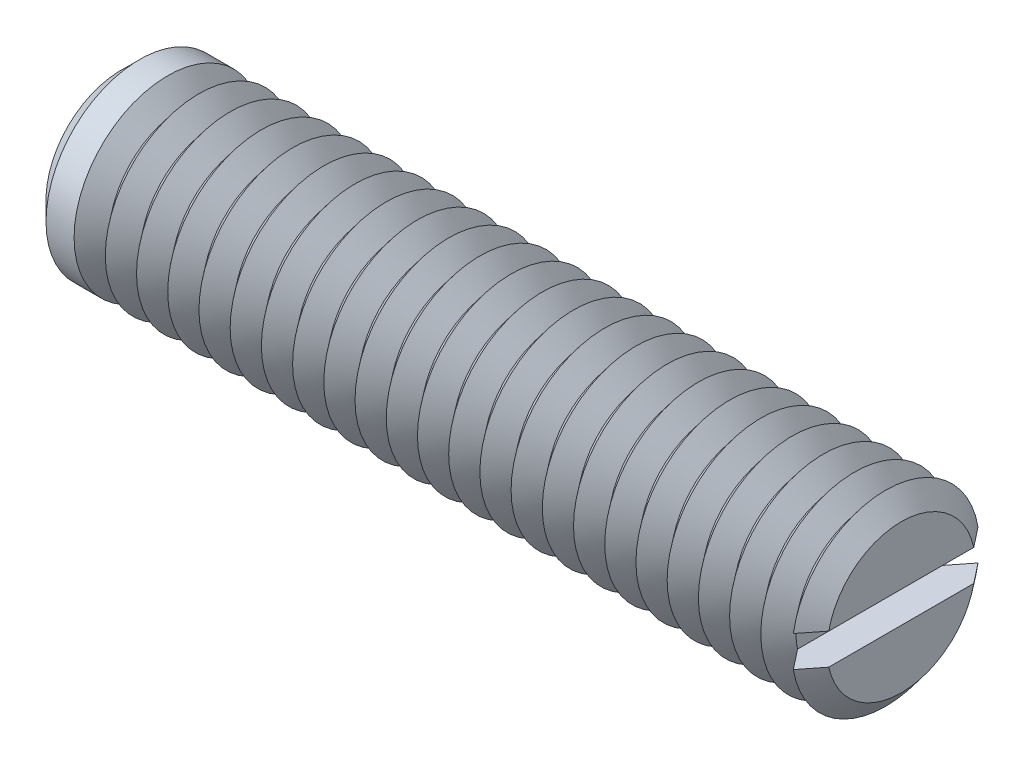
ISO-10303-21;
HEADER;
FILE_DESCRIPTION(('STEP AP214'),'2;1');
FILE_NAME('part.step','',(''),(''),'','','');
FILE_SCHEMA(('AUTOMOTIVE_DESIGN { 1 0 10303 214 1 1 1 1 }'));
ENDSEC;
DATA;
#1=APPLICATION_CONTEXT('core data for automotive mechanical design processes');
#2=APPLICATION_PROTOCOL_DEFINITION('international standard','automotive_design',2000,#1);
#3=PRODUCT_CONTEXT('',#1,'mechanical');
#4=PRODUCT('Part','Part','',(#3));
#5=PRODUCT_RELATED_PRODUCT_CATEGORY('part','',(#4));
#6=PRODUCT_DEFINITION_FORMATION('','',#4);
#7=PRODUCT_DEFINITION_CONTEXT('part definition',#1,'design');
#8=PRODUCT_DEFINITION('design','',#6,#7);
#9=PRODUCT_DEFINITION_SHAPE('','',#8);
#10=(LENGTH_UNIT() NAMED_UNIT(*) SI_UNIT(.MILLI.,.METRE.));
#11=(NAMED_UNIT(*) PLANE_ANGLE_UNIT() SI_UNIT($,.RADIAN.));
#12=(NAMED_UNIT(*) SI_UNIT($,.STERADIAN.) SOLID_ANGLE_UNIT());
#13=UNCERTAINTY_MEASURE_WITH_UNIT(LENGTH_MEASURE(1.E-05),#10,'distance_accuracy_value','');
#14=(GEOMETRIC_REPRESENTATION_CONTEXT(3) GLOBAL_UNCERTAINTY_ASSIGNED_CONTEXT((#13)) GLOBAL_UNIT_ASSIGNED_CONTEXT((#10,
#11,#12)) REPRESENTATION_CONTEXT('',''));
#15=CARTESIAN_POINT('',(0.,0.,0.));
#16=DIRECTION('',(0.,0.,1.));
#17=DIRECTION('',(1.,0.,0.));
#18=AXIS2_PLACEMENT_3D('',#15,#16,#17);
#19=CARTESIAN_POINT('',(12.,0.,0.));
#20=DIRECTION('',(1.,0.,0.));
#21=DIRECTION('',(0.,0.,-1.));
#22=AXIS2_PLACEMENT_3D('',#19,#20,#21);
#23=CONICAL_SURFACE('',#22,3.,0.895664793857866);
#24=CARTESIAN_POINT('',(12.,0.,0.));
#25=DIRECTION('',(-1.,0.,0.));
#26=DIRECTION('',(0.,0.,1.));
#27=AXIS2_PLACEMENT_3D('',#24,#25,#26);
#28=CIRCLE('',#27,3.);
#29=CARTESIAN_POINT('',(12.,-0.5,-2.95803989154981));
#30=VERTEX_POINT('',#29);
#31=CARTESIAN_POINT('',(12.,-0.5,2.95803989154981));
#32=VERTEX_POINT('',#31);
#33=EDGE_CURVE('E117',#30,#32,#28,.T.);
#34=ORIENTED_EDGE('',*,*,#33,.T.);
#35=CARTESIAN_POINT('',(14.8340158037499,-0.5,-6.52054251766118));
#36=CARTESIAN_POINT('',(14.6513674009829,-0.5,-6.29173953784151));
#37=CARTESIAN_POINT('',(14.4687482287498,-0.5,-6.06291320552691));
#38=CARTESIAN_POINT('',(14.1035782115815,-0.5,-5.60514706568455));
#39=CARTESIAN_POINT('',(13.9210273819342,-0.5,-5.376207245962));
#40=CARTESIAN_POINT('',(13.5555297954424,-0.5,-4.9175522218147));
#41=CARTESIAN_POINT('',(13.3725834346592,-0.5,-4.68783670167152));
#42=CARTESIAN_POINT('',(13.0069310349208,-0.5,-4.22827290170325));
#43=CARTESIAN_POINT('',(12.8242249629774,-0.5,-3.99842464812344));
#44=CARTESIAN_POINT('',(12.4431833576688,-0.5,-3.51834247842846));
#45=CARTESIAN_POINT('',(12.2448786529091,-0.5,-3.26808406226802));
#46=CARTESIAN_POINT('',(11.9479597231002,-0.5,-2.89216906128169));
#47=CARTESIAN_POINT('',(11.8490516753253,-0.5,-2.76674461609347));
#48=CARTESIAN_POINT('',(11.6515374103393,-0.5,-2.51567085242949));
#49=CARTESIAN_POINT('',(11.5529311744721,-0.5,-2.39002154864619));
#50=CARTESIAN_POINT('',(11.3563868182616,-0.5,-2.13862277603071));
#51=CARTESIAN_POINT('',(11.2584477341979,-0.5,-2.01287406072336));
#52=CARTESIAN_POINT('',(11.0633111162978,-0.5,-1.76075275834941));
#53=CARTESIAN_POINT('',(10.9661137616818,-0.5,-1.63438003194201));
#54=CARTESIAN_POINT('',(10.8214734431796,-0.5,-1.4440341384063));
#55=CARTESIAN_POINT('',(10.7734745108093,-0.5,-1.38048388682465));
#56=CARTESIAN_POINT('',(10.6780284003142,-0.5,-1.25297092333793));
#57=CARTESIAN_POINT('',(10.630581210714,-0.5,-1.18900822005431));
#58=CARTESIAN_POINT('',(10.5365530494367,-0.5,-1.0604855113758));
#59=CARTESIAN_POINT('',(10.4899717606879,-0.5,-0.995925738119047));
#60=CARTESIAN_POINT('',(10.3981961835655,-0.5,-0.865829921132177));
#61=CARTESIAN_POINT('',(10.3530016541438,-0.5,-0.800294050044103));
#62=CARTESIAN_POINT('',(10.2995678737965,-0.5,-0.719528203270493));
#63=CARTESIAN_POINT('',(10.2901114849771,-0.5,-0.705104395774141));
#64=CARTESIAN_POINT('',(10.2713420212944,-0.5,-0.676163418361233));
#65=CARTESIAN_POINT('',(10.262028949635,-0.5,-0.661646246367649));
#66=CARTESIAN_POINT('',(10.2343355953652,-0.5,-0.617935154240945));
#67=CARTESIAN_POINT('',(10.2162024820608,-0.5,-0.588583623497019));
#68=CARTESIAN_POINT('',(10.1808134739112,-0.5,-0.529281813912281));
#69=CARTESIAN_POINT('',(10.1635591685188,-0.5,-0.499330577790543));
#70=CARTESIAN_POINT('',(10.130358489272,-0.5,-0.43871416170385));
#71=CARTESIAN_POINT('',(10.1144119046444,-0.5,-0.408049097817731));
#72=CARTESIAN_POINT('',(10.0785841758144,-0.5,-0.333745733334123));
#73=CARTESIAN_POINT('',(10.0595664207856,-0.5,-0.289676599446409));
#74=CARTESIAN_POINT('',(10.0278600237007,-0.5,-0.199412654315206));
#75=CARTESIAN_POINT('',(10.0151365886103,-0.5,-0.153231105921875));
#76=CARTESIAN_POINT('',(10.001111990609,-0.5,-0.0687562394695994));
#77=CARTESIAN_POINT('',(9.99800550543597,-0.5,-0.0307838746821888));
#78=CARTESIAN_POINT('',(9.99887220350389,-0.5,0.045057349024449));
#79=CARTESIAN_POINT('',(10.0028411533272,-0.5,0.0829262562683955));
#80=CARTESIAN_POINT('',(10.0147515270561,-0.5,0.146691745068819));
#81=CARTESIAN_POINT('',(10.0212166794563,-0.5,0.172890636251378));
#82=CARTESIAN_POINT('',(10.0365108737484,-0.5,0.22459935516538));
#83=CARTESIAN_POINT('',(10.0453416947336,-0.5,0.250108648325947));
#84=CARTESIAN_POINT('',(10.0648480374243,-0.5,0.300632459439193));
#85=CARTESIAN_POINT('',(10.0755378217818,-0.5,0.325641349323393));
#86=CARTESIAN_POINT('',(10.098235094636,-0.5,0.375035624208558));
#87=CARTESIAN_POINT('',(10.1102421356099,-0.5,0.399421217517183));
#88=CARTESIAN_POINT('',(10.1509435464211,-0.5,0.478106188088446));
#89=CARTESIAN_POINT('',(10.1816009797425,-0.5,0.531380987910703));
#90=CARTESIAN_POINT('',(10.2454790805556,-0.5,0.636383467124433));
#91=CARTESIAN_POINT('',(10.2787021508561,-0.5,0.688109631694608));
#92=CARTESIAN_POINT('',(10.3467342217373,-0.5,0.790686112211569));
#93=CARTESIAN_POINT('',(10.3815468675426,-0.5,0.84153400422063));
#94=CARTESIAN_POINT('',(10.4520982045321,-0.5,0.94254588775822));
#95=CARTESIAN_POINT('',(10.4878365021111,-0.5,0.992710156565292));
#96=CARTESIAN_POINT('',(10.5600131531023,-0.5,1.09268759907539));
#97=CARTESIAN_POINT('',(10.596452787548,-0.5,1.1424998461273));
#98=CARTESIAN_POINT('',(10.6697745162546,-0.5,1.2418047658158));
#99=CARTESIAN_POINT('',(10.7066566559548,-0.5,1.29129740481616));
#100=CARTESIAN_POINT('',(10.8176541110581,-0.5,1.43926830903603));
#101=CARTESIAN_POINT('',(10.8922352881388,-0.5,1.53739673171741));
#102=CARTESIAN_POINT('',(11.047080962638,-0.5,1.73962858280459));
#103=CARTESIAN_POINT('',(11.1273934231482,-0.5,1.84369513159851));
#104=CARTESIAN_POINT('',(11.2885076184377,-0.5,2.05144913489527));
#105=CARTESIAN_POINT('',(11.3693093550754,-0.5,2.15513658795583));
#106=CARTESIAN_POINT('',(11.6121843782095,-0.5,2.46584176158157));
#107=CARTESIAN_POINT('',(11.7747224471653,-0.5,2.67249578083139));
#108=CARTESIAN_POINT('',(12.1005180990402,-0.5,3.08548885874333));
#109=CARTESIAN_POINT('',(12.2637761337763,-0.5,3.29182756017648));
#110=CARTESIAN_POINT('',(12.5906371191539,-0.5,3.70422676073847));
#111=CARTESIAN_POINT('',(12.7542400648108,-0.5,3.91028726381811));
#112=CARTESIAN_POINT('',(13.0774242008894,-0.5,4.31690950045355));
#113=CARTESIAN_POINT('',(13.2369999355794,-0.5,4.51747557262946));
#114=CARTESIAN_POINT('',(13.5562886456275,-0.5,4.91850000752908));
#115=CARTESIAN_POINT('',(13.7160016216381,-0.5,5.11895836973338));
#116=CARTESIAN_POINT('',(14.0353926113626,-0.5,5.51963619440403));
#117=CARTESIAN_POINT('',(14.1950705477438,-0.5,5.71985571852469));
#118=CARTESIAN_POINT('',(14.5144964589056,-0.5,6.12023723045));
#119=CARTESIAN_POINT('',(14.6742444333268,-0.5,6.32039921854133));
#120=CARTESIAN_POINT('',(14.8340158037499,-0.5,6.52054251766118));
#121=B_SPLINE_CURVE_WITH_KNOTS('',3,(#35,#36,#37,#38,#39,#40,#41,#42,#43,#44,#45,#46,#47,#48,
#49,#50,#51,#52,#53,#54,#55,#56,#57,#58,#59,#60,#61,#62,#63,#64,#65,#66,#67,#68,#69,#70,#71,#72,
#73,#74,#75,#76,#77,#78,#79,#80,#81,#82,#83,#84,#85,#86,#87,#88,#89,#90,#91,#92,#93,#94,#95,#96,
#97,#98,#99,#100,#101,#102,#103,#104,#105,#106,#107,#108,#109,#110,#111,#112,#113,#114,#115,
#116,#117,#118,#119,#120),.UNSPECIFIED.,.F.,.F.,(4,2,2,2,2,2,2,2,2,2,2,2,2,2,2,2,2,2,2,2,2,2,2,
2,2,2,2,2,2,2,2,2,2,2,2,2,2,2,2,2,2,2,4),(0.,0.878294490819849,1.75672728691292,
2.63771941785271,3.51857435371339,4.47648054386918,4.95567426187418,5.43483773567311,
5.91300334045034,6.39128103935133,6.63019943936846,6.86911286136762,7.10793700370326,
7.34671939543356,7.39846053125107,7.45020282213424,7.5536944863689,7.65736712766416,
7.76102302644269,7.9047661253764,8.04770552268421,8.1613778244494,8.27498213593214,
8.35581399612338,8.43670681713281,8.51825011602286,8.59976579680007,8.78399479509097,
8.96839847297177,9.15324864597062,9.33802146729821,9.52317177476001,9.70834126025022,
10.0780963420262,10.472454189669,10.8668135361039,11.65555692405,12.4448978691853,
13.2342274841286,14.0031360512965,14.7720482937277,15.5403347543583,16.3086173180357),.UNSPECIFIED.);
#122=CARTESIAN_POINT('',(11.5,-0.5,2.32228361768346));
#123=VERTEX_POINT('',#122);
#124=EDGE_CURVE('E109',#123,#32,#121,.T.);
#125=ORIENTED_EDGE('',*,*,#124,.F.);
#126=CARTESIAN_POINT('',(11.5,0.,0.));
#127=DIRECTION('',(-1.,0.,0.));
#128=DIRECTION('',(0.,0.,1.));
#129=AXIS2_PLACEMENT_3D('',#126,#127,#128);
#130=CIRCLE('',#129,2.37550020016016);
#131=CARTESIAN_POINT('',(11.5,-0.5,-2.32228361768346));
#132=VERTEX_POINT('',#131);
#133=EDGE_CURVE('E408',#132,#123,#130,.T.);
#134=ORIENTED_EDGE('',*,*,#133,.F.);
#135=EDGE_CURVE('E58',#30,#132,#121,.T.);
#136=ORIENTED_EDGE('',*,*,#135,.F.);
#137=EDGE_LOOP('',(#34,#125,#134,#136));
#138=FACE_BOUND('',#137,.T.);
#139=ADVANCED_FACE('F37',(#138),#23,.T.);
#140=CARTESIAN_POINT('',(12.,0.5,2.95803989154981));
#141=VERTEX_POINT('',#140);
#142=CARTESIAN_POINT('',(12.,0.499999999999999,-2.95803989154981));
#143=VERTEX_POINT('',#142);
#144=EDGE_CURVE('E100',#141,#143,#28,.T.);
#145=ORIENTED_EDGE('',*,*,#144,.T.);
#146=CARTESIAN_POINT('',(14.8340158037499,0.5,6.52054251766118));
#147=CARTESIAN_POINT('',(14.6513674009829,0.5,6.29173953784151));
#148=CARTESIAN_POINT('',(14.4687482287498,0.5,6.06291320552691));
#149=CARTESIAN_POINT('',(14.1035782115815,0.5,5.60514706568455));
#150=CARTESIAN_POINT('',(13.9210273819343,0.5,5.376207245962));
#151=CARTESIAN_POINT('',(13.5555297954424,0.5,4.91755222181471));
#152=CARTESIAN_POINT('',(13.3725834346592,0.5,4.68783670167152));
#153=CARTESIAN_POINT('',(13.0069310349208,0.5,4.22827290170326));
#154=CARTESIAN_POINT('',(12.8242249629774,0.5,3.99842464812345));
#155=CARTESIAN_POINT('',(12.4431833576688,0.5,3.51834247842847));
#156=CARTESIAN_POINT('',(12.2448786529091,0.5,3.26808406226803));
#157=CARTESIAN_POINT('',(11.9479597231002,0.5,2.8921690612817));
#158=CARTESIAN_POINT('',(11.8490516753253,0.5,2.76674461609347));
#159=CARTESIAN_POINT('',(11.6515374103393,0.5,2.5156708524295));
#160=CARTESIAN_POINT('',(11.5529311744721,0.5,2.3900215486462));
#161=CARTESIAN_POINT('',(11.3563868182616,0.5,2.13862277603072));
#162=CARTESIAN_POINT('',(11.2584477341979,0.5,2.01287406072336));
#163=CARTESIAN_POINT('',(11.0633111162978,0.5,1.76075275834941));
#164=CARTESIAN_POINT('',(10.9661137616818,0.5,1.63438003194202));
#165=CARTESIAN_POINT('',(10.8214734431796,0.5,1.4440341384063));
#166=CARTESIAN_POINT('',(10.7734745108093,0.5,1.38048388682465));
#167=CARTESIAN_POINT('',(10.6780284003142,0.5,1.25297092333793));
#168=CARTESIAN_POINT('',(10.630581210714,0.5,1.18900822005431));
#169=CARTESIAN_POINT('',(10.5365530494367,0.5,1.0604855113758));
#170=CARTESIAN_POINT('',(10.4899717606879,0.5,0.995925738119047));
#171=CARTESIAN_POINT('',(10.3981961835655,0.5,0.865829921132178));
#172=CARTESIAN_POINT('',(10.3530016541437,0.5,0.800294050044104));
#173=CARTESIAN_POINT('',(10.2995678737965,0.5,0.719528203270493));
#174=CARTESIAN_POINT('',(10.2901114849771,0.5,0.70510439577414));
#175=CARTESIAN_POINT('',(10.2713420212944,0.5,0.676163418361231));
#176=CARTESIAN_POINT('',(10.262028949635,0.5,0.661646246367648));
#177=CARTESIAN_POINT('',(10.2343355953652,0.5,0.617935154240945));
#178=CARTESIAN_POINT('',(10.2162024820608,0.5,0.588583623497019));
#179=CARTESIAN_POINT('',(10.1808134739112,0.5,0.529281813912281));
#180=CARTESIAN_POINT('',(10.1635591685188,0.5,0.499330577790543));
#181=CARTESIAN_POINT('',(10.130358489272,0.5,0.43871416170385));
#182=CARTESIAN_POINT('',(10.1144119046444,0.5,0.408049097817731));
#183=CARTESIAN_POINT('',(10.0785841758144,0.5,0.333745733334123));
#184=CARTESIAN_POINT('',(10.0595664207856,0.5,0.289676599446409));
#185=CARTESIAN_POINT('',(10.0278600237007,0.5,0.199412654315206));
#186=CARTESIAN_POINT('',(10.0151365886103,0.5,0.153231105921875));
#187=CARTESIAN_POINT('',(10.001111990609,0.5,0.0687562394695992));
#188=CARTESIAN_POINT('',(9.99800550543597,0.5,0.0307838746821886));
#189=CARTESIAN_POINT('',(9.99887220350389,0.5,-0.0450573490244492));
#190=CARTESIAN_POINT('',(10.0028411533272,0.5,-0.0829262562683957));
#191=CARTESIAN_POINT('',(10.0147515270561,0.5,-0.14669174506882));
#192=CARTESIAN_POINT('',(10.0212166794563,0.5,-0.172890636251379));
#193=CARTESIAN_POINT('',(10.0365108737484,0.5,-0.22459935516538));
#194=CARTESIAN_POINT('',(10.0453416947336,0.5,-0.250108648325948));
#195=CARTESIAN_POINT('',(10.0648480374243,0.5,-0.300632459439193));
#196=CARTESIAN_POINT('',(10.0755378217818,0.5,-0.325641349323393));
#197=CARTESIAN_POINT('',(10.098235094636,0.5,-0.375035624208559));
#198=CARTESIAN_POINT('',(10.1102421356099,0.5,-0.399421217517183));
#199=CARTESIAN_POINT('',(10.1509435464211,0.5,-0.478106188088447));
#200=CARTESIAN_POINT('',(10.1816009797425,0.5,-0.531380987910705));
#201=CARTESIAN_POINT('',(10.2454790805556,0.5,-0.636383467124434));
#202=CARTESIAN_POINT('',(10.2787021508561,0.5,-0.68810963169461));
#203=CARTESIAN_POINT('',(10.3467342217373,0.5,-0.790686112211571));
#204=CARTESIAN_POINT('',(10.3815468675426,0.5,-0.841534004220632));
#205=CARTESIAN_POINT('',(10.4520982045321,0.5,-0.942545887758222));
#206=CARTESIAN_POINT('',(10.4878365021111,0.5,-0.992710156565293));
#207=CARTESIAN_POINT('',(10.5600131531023,0.5,-1.09268759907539));
#208=CARTESIAN_POINT('',(10.5964527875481,0.5,-1.1424998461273));
#209=CARTESIAN_POINT('',(10.6697745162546,0.5,-1.2418047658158));
#210=CARTESIAN_POINT('',(10.7066566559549,0.5,-1.29129740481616));
#211=CARTESIAN_POINT('',(10.8176541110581,0.5,-1.43926830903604));
#212=CARTESIAN_POINT('',(10.8922352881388,0.5,-1.53739673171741));
#213=CARTESIAN_POINT('',(11.047080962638,0.5,-1.73962858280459));
#214=CARTESIAN_POINT('',(11.1273934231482,0.5,-1.84369513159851));
#215=CARTESIAN_POINT('',(11.2885076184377,0.5,-2.05144913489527));
#216=CARTESIAN_POINT('',(11.3693093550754,0.5,-2.15513658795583));
#217=CARTESIAN_POINT('',(11.6121843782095,0.5,-2.46584176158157));
#218=CARTESIAN_POINT('',(11.7747224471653,0.5,-2.67249578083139));
#219=CARTESIAN_POINT('',(12.1005180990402,0.5,-3.08548885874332));
#220=CARTESIAN_POINT('',(12.2637761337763,0.5,-3.29182756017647));
#221=CARTESIAN_POINT('',(12.5906371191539,0.5,-3.70422676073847));
#222=CARTESIAN_POINT('',(12.7542400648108,0.5,-3.91028726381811));
#223=CARTESIAN_POINT('',(13.0774242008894,0.5,-4.31690950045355));
#224=CARTESIAN_POINT('',(13.2369999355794,0.5,-4.51747557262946));
#225=CARTESIAN_POINT('',(13.5562886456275,0.5,-4.91850000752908));
#226=CARTESIAN_POINT('',(13.7160016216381,0.5,-5.11895836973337));
#227=CARTESIAN_POINT('',(14.0353926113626,0.5,-5.51963619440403));
#228=CARTESIAN_POINT('',(14.1950705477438,0.5,-5.71985571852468));
#229=CARTESIAN_POINT('',(14.5144964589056,0.5,-6.12023723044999));
#230=CARTESIAN_POINT('',(14.6742444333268,0.5,-6.32039921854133));
#231=CARTESIAN_POINT('',(14.8340158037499,0.5,-6.52054251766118));
#232=B_SPLINE_CURVE_WITH_KNOTS('',3,(#146,#147,#148,#149,#150,#151,#152,#153,#154,#155,#156,
#157,#158,#159,#160,#161,#162,#163,#164,#165,#166,#167,#168,#169,#170,#171,#172,#173,#174,#175,
#176,#177,#178,#179,#180,#181,#182,#183,#184,#185,#186,#187,#188,#189,#190,#191,#192,#193,#194,
#195,#196,#197,#198,#199,#200,#201,#202,#203,#204,#205,#206,#207,#208,#209,#210,#211,#212,#213,
#214,#215,#216,#217,#218,#219,#220,#221,#222,#223,#224,#225,#226,#227,#228,#229,#230,#231),
.UNSPECIFIED.,.F.,.F.,(4,2,2,2,2,2,2,2,2,2,2,2,2,2,2,2,2,2,2,2,2,2,2,2,2,2,2,2,2,2,2,2,2,2,2,2,
2,2,2,2,2,2,4),(0.,0.878294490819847,1.75672728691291,2.6377194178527,3.51857435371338,
4.47648054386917,4.95567426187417,5.43483773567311,5.91300334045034,6.39128103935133,
6.63019943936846,6.86911286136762,7.10793700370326,7.34671939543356,7.39846053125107,
7.45020282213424,7.5536944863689,7.65736712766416,7.76102302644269,7.9047661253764,
8.04770552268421,8.1613778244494,8.27498213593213,8.35581399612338,8.43670681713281,
8.51825011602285,8.59976579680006,8.78399479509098,8.96839847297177,9.15324864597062,
9.33802146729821,9.52317177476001,9.70834126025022,10.0780963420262,10.472454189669,
10.8668135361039,11.65555692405,12.4448978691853,13.2342274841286,14.0031360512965,
14.7720482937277,15.5403347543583,16.3086173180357),.UNSPECIFIED.);
#233=CARTESIAN_POINT('',(11.5,0.5,-2.32228361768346));
#234=VERTEX_POINT('',#233);
#235=EDGE_CURVE('E110',#234,#143,#232,.T.);
#236=ORIENTED_EDGE('',*,*,#235,.F.);
#237=CARTESIAN_POINT('',(11.5,0.5,2.32228361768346));
#238=VERTEX_POINT('',#237);
#239=EDGE_CURVE('E103',#238,#234,#130,.T.);
#240=ORIENTED_EDGE('',*,*,#239,.F.);
#241=EDGE_CURVE('E97',#141,#238,#232,.T.);
#242=ORIENTED_EDGE('',*,*,#241,.F.);
#243=EDGE_LOOP('',(#145,#236,#240,#242));
#244=FACE_BOUND('',#243,.T.);
#245=ADVANCED_FACE('F99',(#244),#23,.T.);
#246=CARTESIAN_POINT('',(11.5,0.,0.));
#247=DIRECTION('',(-1.,0.,0.));
#248=DIRECTION('',(0.,0.,1.));
#249=AXIS2_PLACEMENT_3D('',#246,#247,#248);
#250=CONICAL_SURFACE('',#249,2.37550020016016,0.895664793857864);
#251=CARTESIAN_POINT('',(11.,0.,0.));
#252=DIRECTION('',(-1.,0.,0.));
#253=DIRECTION('',(0.,0.,1.));
#254=AXIS2_PLACEMENT_3D('',#251,#252,#253);
#255=CIRCLE('',#254,3.);
#256=CARTESIAN_POINT('',(11.,0.,3.));
#257=VERTEX_POINT('',#256);
#258=EDGE_CURVE('E396',#257,#257,#255,.T.);
#259=ORIENTED_EDGE('',*,*,#258,.F.);
#260=EDGE_LOOP('',(#259));
#261=FACE_BOUND('',#260,.T.);
#262=ORIENTED_EDGE('',*,*,#239,.T.);
#263=EDGE_CURVE('E403',#234,#132,#130,.T.);
#264=ORIENTED_EDGE('',*,*,#263,.T.);
#265=ORIENTED_EDGE('',*,*,#133,.T.);
#266=EDGE_CURVE('E402',#123,#238,#130,.T.);
#267=ORIENTED_EDGE('',*,*,#266,.T.);
#268=EDGE_LOOP('',(#262,#264,#265,#267));
#269=FACE_BOUND('',#268,.T.);
#270=ADVANCED_FACE('F168',(#261,#269),#250,.T.);
#271=CARTESIAN_POINT('',(12.5,0.,0.));
#272=DIRECTION('',(1.,0.,0.));
#273=DIRECTION('',(0.,0.,-1.));
#274=AXIS2_PLACEMENT_3D('',#271,#272,#273);
#275=PLANE('',#274);
#276=CARTESIAN_POINT('',(12.5,0.,0.));
#277=DIRECTION('',(-1.,0.,0.));
#278=DIRECTION('',(0.,0.,1.));
#279=AXIS2_PLACEMENT_3D('',#276,#277,#278);
#280=CIRCLE('',#279,2.37550020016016);
#281=CARTESIAN_POINT('',(12.5,0.5,2.32228361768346));
#282=VERTEX_POINT('',#281);
#283=CARTESIAN_POINT('',(12.5,0.5,-2.32228361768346));
#284=VERTEX_POINT('',#283);
#285=EDGE_CURVE('E160',#282,#284,#280,.T.);
#286=ORIENTED_EDGE('',*,*,#285,.F.);
#287=DIRECTION('',(0.,0.,1.));
#288=VECTOR('',#287,1.);
#289=CARTESIAN_POINT('',(12.5,0.5,0.));
#290=LINE('',#289,#288);
#291=EDGE_CURVE('E122',#284,#282,#290,.T.);
#292=ORIENTED_EDGE('',*,*,#291,.F.);
#293=EDGE_LOOP('',(#286,#292));
#294=FACE_BOUND('',#293,.T.);
#295=ADVANCED_FACE('F172',(#294),#275,.T.);
#296=CARTESIAN_POINT('',(12.5,-0.5,-2.32228361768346));
#297=VERTEX_POINT('',#296);
#298=CARTESIAN_POINT('',(12.5,-0.5,2.32228361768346));
#299=VERTEX_POINT('',#298);
#300=EDGE_CURVE('E66',#297,#299,#280,.T.);
#301=ORIENTED_EDGE('',*,*,#300,.F.);
#302=DIRECTION('',(0.,0.,-1.));
#303=VECTOR('',#302,1.);
#304=CARTESIAN_POINT('',(12.5,-0.5,0.));
#305=LINE('',#304,#303);
#306=EDGE_CURVE('E136',#299,#297,#305,.T.);
#307=ORIENTED_EDGE('',*,*,#306,.F.);
#308=EDGE_LOOP('',(#301,#307));
#309=FACE_BOUND('',#308,.T.);
#310=ADVANCED_FACE('F201',(#309),#275,.T.);
#311=CARTESIAN_POINT('',(12.5,0.,0.));
#312=DIRECTION('',(-1.,0.,0.));
#313=DIRECTION('',(0.,0.,1.));
#314=AXIS2_PLACEMENT_3D('',#311,#312,#313);
#315=CONICAL_SURFACE('',#314,2.37550020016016,0.895664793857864);
#316=ORIENTED_EDGE('',*,*,#144,.F.);
#317=CARTESIAN_POINT('',(9.16598419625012,0.5,-6.52054251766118));
#318=CARTESIAN_POINT('',(9.34863259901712,0.5,-6.29173953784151));
#319=CARTESIAN_POINT('',(9.53125177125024,0.5,-6.06291320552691));
#320=CARTESIAN_POINT('',(9.8964217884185,0.5,-5.60514706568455));
#321=CARTESIAN_POINT('',(10.0789726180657,0.5,-5.376207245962));
#322=CARTESIAN_POINT('',(10.4444702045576,0.5,-4.91755222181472));
#323=CARTESIAN_POINT('',(10.6274165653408,0.5,-4.68783670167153));
#324=CARTESIAN_POINT('',(10.9930689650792,0.5,-4.22827290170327));
#325=CARTESIAN_POINT('',(11.1757750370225,0.5,-3.99842464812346));
#326=CARTESIAN_POINT('',(11.5568166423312,0.5,-3.51834247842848));
#327=CARTESIAN_POINT('',(11.7551213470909,0.5,-3.26808406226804));
#328=CARTESIAN_POINT('',(12.0520402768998,0.5,-2.8921690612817));
#329=CARTESIAN_POINT('',(12.1509483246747,0.5,-2.76674461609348));
#330=CARTESIAN_POINT('',(12.3484625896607,0.5,-2.51567085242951));
#331=CARTESIAN_POINT('',(12.4470688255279,0.5,-2.39002154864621));
#332=CARTESIAN_POINT('',(12.6436131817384,0.5,-2.13862277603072));
#333=CARTESIAN_POINT('',(12.7415522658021,0.5,-2.01287406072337));
#334=CARTESIAN_POINT('',(12.9366888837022,0.5,-1.76075275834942));
#335=CARTESIAN_POINT('',(13.0338862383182,0.5,-1.63438003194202));
#336=CARTESIAN_POINT('',(13.1785265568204,0.5,-1.4440341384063));
#337=CARTESIAN_POINT('',(13.2265254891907,0.5,-1.38048388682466));
#338=CARTESIAN_POINT('',(13.3219715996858,0.5,-1.25297092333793));
#339=CARTESIAN_POINT('',(13.369418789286,0.5,-1.18900822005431));
#340=CARTESIAN_POINT('',(13.4634469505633,0.5,-1.06048551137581));
#341=CARTESIAN_POINT('',(13.5100282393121,0.5,-0.995925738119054));
#342=CARTESIAN_POINT('',(13.6018038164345,0.5,-0.865829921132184));
#343=CARTESIAN_POINT('',(13.6469983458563,0.5,-0.800294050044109));
#344=CARTESIAN_POINT('',(13.7004321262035,0.5,-0.719528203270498));
#345=CARTESIAN_POINT('',(13.7098885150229,0.5,-0.705104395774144));
#346=CARTESIAN_POINT('',(13.7286579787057,0.5,-0.676163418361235));
#347=CARTESIAN_POINT('',(13.737971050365,0.5,-0.661646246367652));
#348=CARTESIAN_POINT('',(13.7656644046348,0.5,-0.617935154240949));
#349=CARTESIAN_POINT('',(13.7837975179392,0.5,-0.588583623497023));
#350=CARTESIAN_POINT('',(13.8191865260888,0.5,-0.529281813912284));
#351=CARTESIAN_POINT('',(13.8364408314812,0.5,-0.499330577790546));
#352=CARTESIAN_POINT('',(13.869641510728,0.5,-0.438714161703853));
#353=CARTESIAN_POINT('',(13.8855880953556,0.5,-0.408049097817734));
#354=CARTESIAN_POINT('',(13.9214158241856,0.5,-0.333745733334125));
#355=CARTESIAN_POINT('',(13.9404335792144,0.5,-0.28967659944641));
#356=CARTESIAN_POINT('',(13.9721399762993,0.5,-0.199412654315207));
#357=CARTESIAN_POINT('',(13.9848634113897,0.5,-0.153231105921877));
#358=CARTESIAN_POINT('',(13.998888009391,0.5,-0.0687562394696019));
#359=CARTESIAN_POINT('',(14.001994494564,0.5,-0.0307838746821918));
#360=CARTESIAN_POINT('',(14.0011277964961,0.5,0.0450573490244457));
#361=CARTESIAN_POINT('',(13.9971588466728,0.5,0.0829262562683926));
#362=CARTESIAN_POINT('',(13.9852484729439,0.5,0.146691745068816));
#363=CARTESIAN_POINT('',(13.9787833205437,0.5,0.172890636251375));
#364=CARTESIAN_POINT('',(13.9634891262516,0.5,0.224599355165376));
#365=CARTESIAN_POINT('',(13.9546583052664,0.5,0.250108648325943));
#366=CARTESIAN_POINT('',(13.9351519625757,0.5,0.300632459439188));
#367=CARTESIAN_POINT('',(13.9244621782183,0.5,0.325641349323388));
#368=CARTESIAN_POINT('',(13.901764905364,0.5,0.375035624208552));
#369=CARTESIAN_POINT('',(13.8897578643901,0.5,0.399421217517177));
#370=CARTESIAN_POINT('',(13.8490564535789,0.5,0.478106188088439));
#371=CARTESIAN_POINT('',(13.8183990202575,0.5,0.531380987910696));
#372=CARTESIAN_POINT('',(13.7545209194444,0.5,0.636383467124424));
#373=CARTESIAN_POINT('',(13.7212978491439,0.5,0.688109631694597));
#374=CARTESIAN_POINT('',(13.6532657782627,0.5,0.790686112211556));
#375=CARTESIAN_POINT('',(13.6184531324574,0.5,0.841534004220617));
#376=CARTESIAN_POINT('',(13.5479017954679,0.5,0.942545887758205));
#377=CARTESIAN_POINT('',(13.512163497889,0.5,0.992710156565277));
#378=CARTESIAN_POINT('',(13.4399868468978,0.5,1.09268759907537));
#379=CARTESIAN_POINT('',(13.403547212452,0.5,1.14249984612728));
#380=CARTESIAN_POINT('',(13.3302254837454,0.5,1.24180476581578));
#381=CARTESIAN_POINT('',(13.2933433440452,0.5,1.29129740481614));
#382=CARTESIAN_POINT('',(13.1823458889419,0.5,1.43926830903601));
#383=CARTESIAN_POINT('',(13.1077647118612,0.5,1.53739673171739));
#384=CARTESIAN_POINT('',(12.952919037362,0.5,1.73962858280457));
#385=CARTESIAN_POINT('',(12.8726065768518,0.5,1.84369513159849));
#386=CARTESIAN_POINT('',(12.7114923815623,0.5,2.05144913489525));
#387=CARTESIAN_POINT('',(12.6306906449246,0.5,2.1551365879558));
#388=CARTESIAN_POINT('',(12.3878156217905,0.5,2.46584176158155));
#389=CARTESIAN_POINT('',(12.2252775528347,0.5,2.67249578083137));
#390=CARTESIAN_POINT('',(11.8994819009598,0.5,3.08548885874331));
#391=CARTESIAN_POINT('',(11.7362238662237,0.5,3.29182756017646));
#392=CARTESIAN_POINT('',(11.4093628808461,0.5,3.70422676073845));
#393=CARTESIAN_POINT('',(11.2457599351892,0.5,3.9102872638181));
#394=CARTESIAN_POINT('',(10.9225757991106,0.5,4.31690950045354));
#395=CARTESIAN_POINT('',(10.7630000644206,0.5,4.51747557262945));
#396=CARTESIAN_POINT('',(10.4437113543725,0.5,4.91850000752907));
#397=CARTESIAN_POINT('',(10.2839983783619,0.5,5.11895836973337));
#398=CARTESIAN_POINT('',(9.96460738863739,0.5,5.51963619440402));
#399=CARTESIAN_POINT('',(9.80492945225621,0.5,5.71985571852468));
#400=CARTESIAN_POINT('',(9.48550354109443,0.5,6.12023723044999));
#401=CARTESIAN_POINT('',(9.32575556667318,0.5,6.32039921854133));
#402=CARTESIAN_POINT('',(9.16598419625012,0.5,6.52054251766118));
#403=B_SPLINE_CURVE_WITH_KNOTS('',3,(#317,#318,#319,#320,#321,#322,#323,#324,#325,#326,#327,
#328,#329,#330,#331,#332,#333,#334,#335,#336,#337,#338,#339,#340,#341,#342,#343,#344,#345,#346,
#347,#348,#349,#350,#351,#352,#353,#354,#355,#356,#357,#358,#359,#360,#361,#362,#363,#364,#365,
#366,#367,#368,#369,#370,#371,#372,#373,#374,#375,#376,#377,#378,#379,#380,#381,#382,#383,#384,
#385,#386,#387,#388,#389,#390,#391,#392,#393,#394,#395,#396,#397,#398,#399,#400,#401,#402),
.UNSPECIFIED.,.F.,.F.,(4,2,2,2,2,2,2,2,2,2,2,2,2,2,2,2,2,2,2,2,2,2,2,2,2,2,2,2,2,2,2,2,2,2,2,2,
2,2,2,2,2,2,4),(0.,0.878294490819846,1.75672728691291,2.63771941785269,3.51857435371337,
4.47648054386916,4.95567426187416,5.4348377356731,5.91300334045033,6.39128103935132,
6.63019943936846,6.86911286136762,7.10793700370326,7.34671939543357,7.39846053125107,
7.45020282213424,7.55369448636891,7.65736712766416,7.76102302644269,7.90476612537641,
8.04770552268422,8.16137782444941,8.27498213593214,8.35581399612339,8.43670681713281,
8.51825011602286,8.59976579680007,8.78399479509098,8.96839847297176,9.15324864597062,
9.3380214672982,9.52317177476,9.70834126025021,10.0780963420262,10.472454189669,
10.8668135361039,11.65555692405,12.4448978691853,13.2342274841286,14.0031360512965,
14.7720482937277,15.5403347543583,16.3086173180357),.UNSPECIFIED.);
#404=EDGE_CURVE('E41',#282,#141,#403,.T.);
#405=ORIENTED_EDGE('',*,*,#404,.F.);
#406=ORIENTED_EDGE('',*,*,#285,.T.);
#407=EDGE_CURVE('E11',#143,#284,#403,.T.);
#408=ORIENTED_EDGE('',*,*,#407,.F.);
#409=EDGE_LOOP('',(#316,#405,#406,#408));
#410=FACE_BOUND('',#409,.T.);
#411=ADVANCED_FACE('F114',(#410),#315,.T.);
#412=CARTESIAN_POINT('',(12.5,0.5,-4.5));
#413=DIRECTION('',(0.,1.,0.));
#414=DIRECTION('',(-1.,0.,0.));
#415=AXIS2_PLACEMENT_3D('',#412,#413,#414);
#416=PLANE('',#415);
#417=ORIENTED_EDGE('',*,*,#404,.T.);
#418=ORIENTED_EDGE('',*,*,#241,.T.);
#419=DIRECTION('',(0.,0.,1.));
#420=VECTOR('',#419,1.);
#421=CARTESIAN_POINT('',(11.5,0.5,-4.5));
#422=LINE('',#421,#420);
#423=EDGE_CURVE('E145',#234,#238,#422,.T.);
#424=ORIENTED_EDGE('',*,*,#423,.F.);
#425=ORIENTED_EDGE('',*,*,#235,.T.);
#426=ORIENTED_EDGE('',*,*,#407,.T.);
#427=ORIENTED_EDGE('',*,*,#291,.T.);
#428=EDGE_LOOP('',(#417,#418,#424,#425,#426,#427));
#429=FACE_BOUND('',#428,.T.);
#430=ADVANCED_FACE('F120',(#429),#416,.F.);
#431=ORIENTED_EDGE('',*,*,#33,.F.);
#432=CARTESIAN_POINT('',(9.16598419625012,-0.5,6.52054251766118));
#433=CARTESIAN_POINT('',(9.34863259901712,-0.5,6.29173953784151));
#434=CARTESIAN_POINT('',(9.53125177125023,-0.5,6.06291320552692));
#435=CARTESIAN_POINT('',(9.89642178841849,-0.5,5.60514706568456));
#436=CARTESIAN_POINT('',(10.0789726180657,-0.5,5.37620724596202));
#437=CARTESIAN_POINT('',(10.4444702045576,-0.5,4.91755222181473));
#438=CARTESIAN_POINT('',(10.6274165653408,-0.5,4.68783670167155));
#439=CARTESIAN_POINT('',(10.9930689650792,-0.5,4.22827290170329));
#440=CARTESIAN_POINT('',(11.1757750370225,-0.5,3.99842464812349));
#441=CARTESIAN_POINT('',(11.5568166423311,-0.5,3.5183424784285));
#442=CARTESIAN_POINT('',(11.7551213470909,-0.5,3.26808406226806));
#443=CARTESIAN_POINT('',(12.0520402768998,-0.5,2.89216906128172));
#444=CARTESIAN_POINT('',(12.1509483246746,-0.5,2.7667446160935));
#445=CARTESIAN_POINT('',(12.3484625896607,-0.5,2.51567085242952));
#446=CARTESIAN_POINT('',(12.4470688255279,-0.5,2.39002154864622));
#447=CARTESIAN_POINT('',(12.6436131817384,-0.5,2.13862277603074));
#448=CARTESIAN_POINT('',(12.7415522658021,-0.5,2.01287406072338));
#449=CARTESIAN_POINT('',(12.9366888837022,-0.5,1.76075275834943));
#450=CARTESIAN_POINT('',(13.0338862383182,-0.5,1.63438003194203));
#451=CARTESIAN_POINT('',(13.1785265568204,-0.5,1.44403413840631));
#452=CARTESIAN_POINT('',(13.2265254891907,-0.5,1.38048388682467));
#453=CARTESIAN_POINT('',(13.3219715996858,-0.5,1.25297092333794));
#454=CARTESIAN_POINT('',(13.369418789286,-0.5,1.18900822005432));
#455=CARTESIAN_POINT('',(13.4634469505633,-0.5,1.06048551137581));
#456=CARTESIAN_POINT('',(13.5100282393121,-0.5,0.995925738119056));
#457=CARTESIAN_POINT('',(13.6018038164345,-0.5,0.865829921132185));
#458=CARTESIAN_POINT('',(13.6469983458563,-0.5,0.80029405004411));
#459=CARTESIAN_POINT('',(13.7004321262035,-0.5,0.719528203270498));
#460=CARTESIAN_POINT('',(13.7098885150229,-0.5,0.705104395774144));
#461=CARTESIAN_POINT('',(13.7286579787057,-0.5,0.676163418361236));
#462=CARTESIAN_POINT('',(13.737971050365,-0.5,0.661646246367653));
#463=CARTESIAN_POINT('',(13.7656644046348,-0.5,0.617935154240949));
#464=CARTESIAN_POINT('',(13.7837975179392,-0.5,0.588583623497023));
#465=CARTESIAN_POINT('',(13.8191865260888,-0.5,0.529281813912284));
#466=CARTESIAN_POINT('',(13.8364408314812,-0.5,0.499330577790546));
#467=CARTESIAN_POINT('',(13.869641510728,-0.5,0.438714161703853));
#468=CARTESIAN_POINT('',(13.8855880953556,-0.5,0.408049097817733));
#469=CARTESIAN_POINT('',(13.9214158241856,-0.5,0.333745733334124));
#470=CARTESIAN_POINT('',(13.9404335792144,-0.5,0.28967659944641));
#471=CARTESIAN_POINT('',(13.9721399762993,-0.5,0.199412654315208));
#472=CARTESIAN_POINT('',(13.9848634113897,-0.5,0.153231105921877));
#473=CARTESIAN_POINT('',(13.998888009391,-0.5,0.0687562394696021));
#474=CARTESIAN_POINT('',(14.001994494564,-0.5,0.0307838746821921));
#475=CARTESIAN_POINT('',(14.0011277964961,-0.5,-0.0450573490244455));
#476=CARTESIAN_POINT('',(13.9971588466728,-0.5,-0.0829262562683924));
#477=CARTESIAN_POINT('',(13.9852484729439,-0.5,-0.146691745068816));
#478=CARTESIAN_POINT('',(13.9787833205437,-0.5,-0.172890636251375));
#479=CARTESIAN_POINT('',(13.9634891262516,-0.5,-0.224599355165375));
#480=CARTESIAN_POINT('',(13.9546583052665,-0.5,-0.250108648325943));
#481=CARTESIAN_POINT('',(13.9351519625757,-0.5,-0.300632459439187));
#482=CARTESIAN_POINT('',(13.9244621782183,-0.5,-0.325641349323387));
#483=CARTESIAN_POINT('',(13.901764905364,-0.5,-0.375035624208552));
#484=CARTESIAN_POINT('',(13.8897578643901,-0.5,-0.399421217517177));
#485=CARTESIAN_POINT('',(13.8490564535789,-0.5,-0.478106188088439));
#486=CARTESIAN_POINT('',(13.8183990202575,-0.5,-0.531380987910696));
#487=CARTESIAN_POINT('',(13.7545209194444,-0.5,-0.636383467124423));
#488=CARTESIAN_POINT('',(13.7212978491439,-0.5,-0.688109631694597));
#489=CARTESIAN_POINT('',(13.6532657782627,-0.5,-0.790686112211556));
#490=CARTESIAN_POINT('',(13.6184531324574,-0.5,-0.841534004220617));
#491=CARTESIAN_POINT('',(13.5479017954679,-0.5,-0.942545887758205));
#492=CARTESIAN_POINT('',(13.512163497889,-0.5,-0.992710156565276));
#493=CARTESIAN_POINT('',(13.4399868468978,-0.5,-1.09268759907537));
#494=CARTESIAN_POINT('',(13.403547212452,-0.5,-1.14249984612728));
#495=CARTESIAN_POINT('',(13.3302254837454,-0.5,-1.24180476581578));
#496=CARTESIAN_POINT('',(13.2933433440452,-0.5,-1.29129740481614));
#497=CARTESIAN_POINT('',(13.1823458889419,-0.5,-1.43926830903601));
#498=CARTESIAN_POINT('',(13.1077647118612,-0.5,-1.53739673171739));
#499=CARTESIAN_POINT('',(12.952919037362,-0.5,-1.73962858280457));
#500=CARTESIAN_POINT('',(12.8726065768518,-0.5,-1.84369513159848));
#501=CARTESIAN_POINT('',(12.7114923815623,-0.5,-2.05144913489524));
#502=CARTESIAN_POINT('',(12.6306906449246,-0.5,-2.1551365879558));
#503=CARTESIAN_POINT('',(12.3878156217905,-0.5,-2.46584176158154));
#504=CARTESIAN_POINT('',(12.2252775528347,-0.5,-2.67249578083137));
#505=CARTESIAN_POINT('',(11.8994819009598,-0.5,-3.0854888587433));
#506=CARTESIAN_POINT('',(11.7362238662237,-0.5,-3.29182756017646));
#507=CARTESIAN_POINT('',(11.4093628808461,-0.5,-3.70422676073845));
#508=CARTESIAN_POINT('',(11.2457599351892,-0.5,-3.91028726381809));
#509=CARTESIAN_POINT('',(10.9225757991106,-0.5,-4.31690950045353));
#510=CARTESIAN_POINT('',(10.7630000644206,-0.5,-4.51747557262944));
#511=CARTESIAN_POINT('',(10.4437113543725,-0.5,-4.91850000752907));
#512=CARTESIAN_POINT('',(10.2839983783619,-0.5,-5.11895836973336));
#513=CARTESIAN_POINT('',(9.96460738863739,-0.5,-5.51963619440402));
#514=CARTESIAN_POINT('',(9.80492945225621,-0.5,-5.71985571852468));
#515=CARTESIAN_POINT('',(9.48550354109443,-0.5,-6.12023723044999));
#516=CARTESIAN_POINT('',(9.32575556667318,-0.5,-6.32039921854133));
#517=CARTESIAN_POINT('',(9.16598419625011,-0.5,-6.52054251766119));
#518=B_SPLINE_CURVE_WITH_KNOTS('',3,(#432,#433,#434,#435,#436,#437,#438,#439,#440,#441,#442,
#443,#444,#445,#446,#447,#448,#449,#450,#451,#452,#453,#454,#455,#456,#457,#458,#459,#460,#461,
#462,#463,#464,#465,#466,#467,#468,#469,#470,#471,#472,#473,#474,#475,#476,#477,#478,#479,#480,
#481,#482,#483,#484,#485,#486,#487,#488,#489,#490,#491,#492,#493,#494,#495,#496,#497,#498,#499,
#500,#501,#502,#503,#504,#505,#506,#507,#508,#509,#510,#511,#512,#513,#514,#515,#516,#517),
.UNSPECIFIED.,.F.,.F.,(4,2,2,2,2,2,2,2,2,2,2,2,2,2,2,2,2,2,2,2,2,2,2,2,2,2,2,2,2,2,2,2,2,2,2,2,
2,2,2,2,2,2,4),(0.,0.878294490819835,1.75672728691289,2.63771941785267,3.51857435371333,
4.47648054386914,4.95567426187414,5.43483773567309,5.91300334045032,6.39128103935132,
6.63019943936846,6.86911286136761,7.10793700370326,7.34671939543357,7.39846053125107,
7.45020282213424,7.55369448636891,7.65736712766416,7.76102302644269,7.90476612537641,
8.04770552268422,8.16137782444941,8.27498213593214,8.35581399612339,8.43670681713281,
8.51825011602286,8.59976579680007,8.78399479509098,8.96839847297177,9.15324864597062,
9.3380214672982,9.52317177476,9.70834126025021,10.0780963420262,10.472454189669,
10.8668135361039,11.65555692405,12.4448978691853,13.2342274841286,14.0031360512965,
14.7720482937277,15.5403347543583,16.3086173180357),.UNSPECIFIED.);
#519=EDGE_CURVE('E152',#297,#30,#518,.T.);
#520=ORIENTED_EDGE('',*,*,#519,.F.);
#521=ORIENTED_EDGE('',*,*,#300,.T.);
#522=EDGE_CURVE('E148',#32,#299,#518,.T.);
#523=ORIENTED_EDGE('',*,*,#522,.F.);
#524=EDGE_LOOP('',(#431,#520,#521,#523));
#525=FACE_BOUND('',#524,.T.);
#526=ADVANCED_FACE('F164',(#525),#315,.T.);
#527=CARTESIAN_POINT('',(12.5,-0.5,-4.5));
#528=DIRECTION('',(0.,-1.,0.));
#529=DIRECTION('',(0.,0.,-1.));
#530=AXIS2_PLACEMENT_3D('',#527,#528,#529);
#531=PLANE('',#530);
#532=ORIENTED_EDGE('',*,*,#519,.T.);
#533=ORIENTED_EDGE('',*,*,#135,.T.);
#534=DIRECTION('',(0.,0.,1.));
#535=VECTOR('',#534,1.);
#536=CARTESIAN_POINT('',(11.5,-0.5,-4.5));
#537=LINE('',#536,#535);
#538=EDGE_CURVE('E144',#132,#123,#537,.T.);
#539=ORIENTED_EDGE('',*,*,#538,.T.);
#540=ORIENTED_EDGE('',*,*,#124,.T.);
#541=ORIENTED_EDGE('',*,*,#522,.T.);
#542=ORIENTED_EDGE('',*,*,#306,.T.);
#543=EDGE_LOOP('',(#532,#533,#539,#540,#541,#542));
#544=FACE_BOUND('',#543,.T.);
#545=ADVANCED_FACE('F161',(#544),#531,.F.);
#546=CARTESIAN_POINT('',(11.5,0.5,-4.5));
#547=DIRECTION('',(-1.,0.,0.));
#548=DIRECTION('',(0.,0.,1.));
#549=AXIS2_PLACEMENT_3D('',#546,#547,#548);
#550=PLANE('',#549);
#551=ORIENTED_EDGE('',*,*,#538,.F.);
#552=ORIENTED_EDGE('',*,*,#263,.F.);
#553=ORIENTED_EDGE('',*,*,#423,.T.);
#554=ORIENTED_EDGE('',*,*,#266,.F.);
#555=EDGE_LOOP('',(#551,#552,#553,#554));
#556=FACE_BOUND('',#555,.T.);
#557=ADVANCED_FACE('F412',(#556),#550,.F.);
#558=CARTESIAN_POINT('',(10.5,0.,0.));
#559=DIRECTION('',(-1.,0.,0.));
#560=DIRECTION('',(0.,0.,1.));
#561=AXIS2_PLACEMENT_3D('',#558,#559,#560);
#562=CONICAL_SURFACE('',#561,2.37550020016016,0.895664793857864);
#563=CARTESIAN_POINT('',(10.,0.,0.));
#564=DIRECTION('',(-1.,0.,0.));
#565=DIRECTION('',(0.,0.,1.));
#566=AXIS2_PLACEMENT_3D('',#563,#564,#565);
#567=CIRCLE('',#566,3.);
#568=CARTESIAN_POINT('',(10.,0.,3.));
#569=VERTEX_POINT('',#568);
#570=EDGE_CURVE('E389',#569,#569,#567,.T.);
#571=ORIENTED_EDGE('',*,*,#570,.F.);
#572=EDGE_LOOP('',(#571));
#573=FACE_BOUND('',#572,.T.);
#574=CARTESIAN_POINT('',(10.5,0.,0.));
#575=DIRECTION('',(-1.,0.,0.));
#576=DIRECTION('',(0.,0.,1.));
#577=AXIS2_PLACEMENT_3D('',#574,#575,#576);
#578=CIRCLE('',#577,2.37550020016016);
#579=CARTESIAN_POINT('',(10.5,0.,2.37550020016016));
#580=VERTEX_POINT('',#579);
#581=EDGE_CURVE('E399',#580,#580,#578,.T.);
#582=ORIENTED_EDGE('',*,*,#581,.T.);
#583=EDGE_LOOP('',(#582));
#584=FACE_BOUND('',#583,.T.);
#585=ADVANCED_FACE('F177',(#573,#584),#562,.T.);
#586=CARTESIAN_POINT('',(11.,0.,0.));
#587=DIRECTION('',(1.,0.,0.));
#588=DIRECTION('',(0.,0.,-1.));
#589=AXIS2_PLACEMENT_3D('',#586,#587,#588);
#590=CONICAL_SURFACE('',#589,3.,0.895664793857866);
#591=ORIENTED_EDGE('',*,*,#581,.F.);
#592=EDGE_LOOP('',(#591));
#593=FACE_BOUND('',#592,.T.);
#594=ORIENTED_EDGE('',*,*,#258,.T.);
#595=EDGE_LOOP('',(#594));
#596=FACE_BOUND('',#595,.T.);
#597=ADVANCED_FACE('F418',(#593,#596),#590,.T.);
#598=CARTESIAN_POINT('',(9.5,0.,0.));
#599=DIRECTION('',(-1.,0.,0.));
#600=DIRECTION('',(0.,0.,1.));
#601=AXIS2_PLACEMENT_3D('',#598,#599,#600);
#602=CONICAL_SURFACE('',#601,2.37550020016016,0.895664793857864);
#603=CARTESIAN_POINT('',(9.,0.,0.));
#604=DIRECTION('',(-1.,0.,0.));
#605=DIRECTION('',(0.,0.,1.));
#606=AXIS2_PLACEMENT_3D('',#603,#604,#605);
#607=CIRCLE('',#606,3.);
#608=CARTESIAN_POINT('',(9.,0.,3.));
#609=VERTEX_POINT('',#608);
#610=EDGE_CURVE('E381',#609,#609,#607,.T.);
#611=ORIENTED_EDGE('',*,*,#610,.F.);
#612=EDGE_LOOP('',(#611));
#613=FACE_BOUND('',#612,.T.);
#614=CARTESIAN_POINT('',(9.5,0.,0.));
#615=DIRECTION('',(-1.,0.,0.));
#616=DIRECTION('',(0.,0.,1.));
#617=AXIS2_PLACEMENT_3D('',#614,#615,#616);
#618=CIRCLE('',#617,2.37550020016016);
#619=CARTESIAN_POINT('',(9.5,0.,2.37550020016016));
#620=VERTEX_POINT('',#619);
#621=EDGE_CURVE('E392',#620,#620,#618,.T.);
#622=ORIENTED_EDGE('',*,*,#621,.T.);
#623=EDGE_LOOP('',(#622));
#624=FACE_BOUND('',#623,.T.);
#625=ADVANCED_FACE('F482',(#613,#624),#602,.T.);
#626=CARTESIAN_POINT('',(10.,0.,0.));
#627=DIRECTION('',(1.,0.,0.));
#628=DIRECTION('',(0.,0.,-1.));
#629=AXIS2_PLACEMENT_3D('',#626,#627,#628);
#630=CONICAL_SURFACE('',#629,3.,0.895664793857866);
#631=ORIENTED_EDGE('',*,*,#621,.F.);
#632=EDGE_LOOP('',(#631));
#633=FACE_BOUND('',#632,.T.);
#634=ORIENTED_EDGE('',*,*,#570,.T.);
#635=EDGE_LOOP('',(#634));
#636=FACE_BOUND('',#635,.T.);
#637=ADVANCED_FACE('F491',(#633,#636),#630,.T.);
#638=CARTESIAN_POINT('',(8.5,0.,0.));
#639=DIRECTION('',(-1.,0.,0.));
#640=DIRECTION('',(0.,0.,1.));
#641=AXIS2_PLACEMENT_3D('',#638,#639,#640);
#642=CONICAL_SURFACE('',#641,2.37550020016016,0.895664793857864);
#643=CARTESIAN_POINT('',(8.,0.,0.));
#644=DIRECTION('',(-1.,0.,0.));
#645=DIRECTION('',(0.,0.,1.));
#646=AXIS2_PLACEMENT_3D('',#643,#644,#645);
#647=CIRCLE('',#646,3.);
#648=CARTESIAN_POINT('',(8.,0.,3.));
#649=VERTEX_POINT('',#648);
#650=EDGE_CURVE('E373',#649,#649,#647,.T.);
#651=ORIENTED_EDGE('',*,*,#650,.F.);
#652=EDGE_LOOP('',(#651));
#653=FACE_BOUND('',#652,.T.);
#654=CARTESIAN_POINT('',(8.5,0.,0.));
#655=DIRECTION('',(-1.,0.,0.));
#656=DIRECTION('',(0.,0.,1.));
#657=AXIS2_PLACEMENT_3D('',#654,#655,#656);
#658=CIRCLE('',#657,2.37550020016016);
#659=CARTESIAN_POINT('',(8.5,0.,2.37550020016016));
#660=VERTEX_POINT('',#659);
#661=EDGE_CURVE('E385',#660,#660,#658,.T.);
#662=ORIENTED_EDGE('',*,*,#661,.T.);
#663=EDGE_LOOP('',(#662));
#664=FACE_BOUND('',#663,.T.);
#665=ADVANCED_FACE('F501',(#653,#664),#642,.T.);
#666=CARTESIAN_POINT('',(9.,0.,0.));
#667=DIRECTION('',(1.,0.,0.));
#668=DIRECTION('',(0.,0.,-1.));
#669=AXIS2_PLACEMENT_3D('',#666,#667,#668);
#670=CONICAL_SURFACE('',#669,3.,0.895664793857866);
#671=ORIENTED_EDGE('',*,*,#661,.F.);
#672=EDGE_LOOP('',(#671));
#673=FACE_BOUND('',#672,.T.);
#674=ORIENTED_EDGE('',*,*,#610,.T.);
#675=EDGE_LOOP('',(#674));
#676=FACE_BOUND('',#675,.T.);
#677=ADVANCED_FACE('F511',(#673,#676),#670,.T.);
#678=CARTESIAN_POINT('',(7.5,0.,0.));
#679=DIRECTION('',(-1.,0.,0.));
#680=DIRECTION('',(0.,0.,1.));
#681=AXIS2_PLACEMENT_3D('',#678,#679,#680);
#682=CONICAL_SURFACE('',#681,2.37550020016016,0.895664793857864);
#683=CARTESIAN_POINT('',(7.,0.,0.));
#684=DIRECTION('',(-1.,0.,0.));
#685=DIRECTION('',(0.,0.,1.));
#686=AXIS2_PLACEMENT_3D('',#683,#684,#685);
#687=CIRCLE('',#686,3.);
#688=CARTESIAN_POINT('',(7.,0.,3.));
#689=VERTEX_POINT('',#688);
#690=EDGE_CURVE('E365',#689,#689,#687,.T.);
#691=ORIENTED_EDGE('',*,*,#690,.F.);
#692=EDGE_LOOP('',(#691));
#693=FACE_BOUND('',#692,.T.);
#694=CARTESIAN_POINT('',(7.5,0.,0.));
#695=DIRECTION('',(-1.,0.,0.));
#696=DIRECTION('',(0.,0.,1.));
#697=AXIS2_PLACEMENT_3D('',#694,#695,#696);
#698=CIRCLE('',#697,2.37550020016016);
#699=CARTESIAN_POINT('',(7.5,0.,2.37550020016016));
#700=VERTEX_POINT('',#699);
#701=EDGE_CURVE('E377',#700,#700,#698,.T.);
#702=ORIENTED_EDGE('',*,*,#701,.T.);
#703=EDGE_LOOP('',(#702));
#704=FACE_BOUND('',#703,.T.);
#705=ADVANCED_FACE('F521',(#693,#704),#682,.T.);
#706=CARTESIAN_POINT('',(8.,0.,0.));
#707=DIRECTION('',(1.,0.,0.));
#708=DIRECTION('',(0.,0.,-1.));
#709=AXIS2_PLACEMENT_3D('',#706,#707,#708);
#710=CONICAL_SURFACE('',#709,3.,0.895664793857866);
#711=ORIENTED_EDGE('',*,*,#701,.F.);
#712=EDGE_LOOP('',(#711));
#713=FACE_BOUND('',#712,.T.);
#714=ORIENTED_EDGE('',*,*,#650,.T.);
#715=EDGE_LOOP('',(#714));
#716=FACE_BOUND('',#715,.T.);
#717=ADVANCED_FACE('F531',(#713,#716),#710,.T.);
#718=CARTESIAN_POINT('',(6.5,0.,0.));
#719=DIRECTION('',(-1.,0.,0.));
#720=DIRECTION('',(0.,0.,1.));
#721=AXIS2_PLACEMENT_3D('',#718,#719,#720);
#722=CONICAL_SURFACE('',#721,2.37550020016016,0.895664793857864);
#723=CARTESIAN_POINT('',(6.,0.,0.));
#724=DIRECTION('',(-1.,0.,0.));
#725=DIRECTION('',(0.,0.,1.));
#726=AXIS2_PLACEMENT_3D('',#723,#724,#725);
#727=CIRCLE('',#726,3.);
#728=CARTESIAN_POINT('',(6.,0.,3.));
#729=VERTEX_POINT('',#728);
#730=EDGE_CURVE('E357',#729,#729,#727,.T.);
#731=ORIENTED_EDGE('',*,*,#730,.F.);
#732=EDGE_LOOP('',(#731));
#733=FACE_BOUND('',#732,.T.);
#734=CARTESIAN_POINT('',(6.5,0.,0.));
#735=DIRECTION('',(-1.,0.,0.));
#736=DIRECTION('',(0.,0.,1.));
#737=AXIS2_PLACEMENT_3D('',#734,#735,#736);
#738=CIRCLE('',#737,2.37550020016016);
#739=CARTESIAN_POINT('',(6.5,0.,2.37550020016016));
#740=VERTEX_POINT('',#739);
#741=EDGE_CURVE('E369',#740,#740,#738,.T.);
#742=ORIENTED_EDGE('',*,*,#741,.T.);
#743=EDGE_LOOP('',(#742));
#744=FACE_BOUND('',#743,.T.);
#745=ADVANCED_FACE('F541',(#733,#744),#722,.T.);
#746=CARTESIAN_POINT('',(7.,0.,0.));
#747=DIRECTION('',(1.,0.,0.));
#748=DIRECTION('',(0.,0.,-1.));
#749=AXIS2_PLACEMENT_3D('',#746,#747,#748);
#750=CONICAL_SURFACE('',#749,3.,0.895664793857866);
#751=ORIENTED_EDGE('',*,*,#741,.F.);
#752=EDGE_LOOP('',(#751));
#753=FACE_BOUND('',#752,.T.);
#754=ORIENTED_EDGE('',*,*,#690,.T.);
#755=EDGE_LOOP('',(#754));
#756=FACE_BOUND('',#755,.T.);
#757=ADVANCED_FACE('F551',(#753,#756),#750,.T.);
#758=CARTESIAN_POINT('',(5.5,0.,0.));
#759=DIRECTION('',(-1.,0.,0.));
#760=DIRECTION('',(0.,0.,1.));
#761=AXIS2_PLACEMENT_3D('',#758,#759,#760);
#762=CONICAL_SURFACE('',#761,2.37550020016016,0.895664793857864);
#763=CARTESIAN_POINT('',(5.,0.,0.));
#764=DIRECTION('',(-1.,0.,0.));
#765=DIRECTION('',(0.,0.,1.));
#766=AXIS2_PLACEMENT_3D('',#763,#764,#765);
#767=CIRCLE('',#766,3.);
#768=CARTESIAN_POINT('',(5.,0.,3.));
#769=VERTEX_POINT('',#768);
#770=EDGE_CURVE('E350',#769,#769,#767,.T.);
#771=ORIENTED_EDGE('',*,*,#770,.F.);
#772=EDGE_LOOP('',(#771));
#773=FACE_BOUND('',#772,.T.);
#774=CARTESIAN_POINT('',(5.5,0.,0.));
#775=DIRECTION('',(-1.,0.,0.));
#776=DIRECTION('',(0.,0.,1.));
#777=AXIS2_PLACEMENT_3D('',#774,#775,#776);
#778=CIRCLE('',#777,2.37550020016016);
#779=CARTESIAN_POINT('',(5.5,0.,2.37550020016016));
#780=VERTEX_POINT('',#779);
#781=EDGE_CURVE('E361',#780,#780,#778,.T.);
#782=ORIENTED_EDGE('',*,*,#781,.T.);
#783=EDGE_LOOP('',(#782));
#784=FACE_BOUND('',#783,.T.);
#785=ADVANCED_FACE('F561',(#773,#784),#762,.T.);
#786=CARTESIAN_POINT('',(6.,0.,0.));
#787=DIRECTION('',(1.,0.,0.));
#788=DIRECTION('',(0.,0.,-1.));
#789=AXIS2_PLACEMENT_3D('',#786,#787,#788);
#790=CONICAL_SURFACE('',#789,3.,0.895664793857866);
#791=ORIENTED_EDGE('',*,*,#781,.F.);
#792=EDGE_LOOP('',(#791));
#793=FACE_BOUND('',#792,.T.);
#794=ORIENTED_EDGE('',*,*,#730,.T.);
#795=EDGE_LOOP('',(#794));
#796=FACE_BOUND('',#795,.T.);
#797=ADVANCED_FACE('F571',(#793,#796),#790,.T.);
#798=CARTESIAN_POINT('',(4.5,0.,0.));
#799=DIRECTION('',(-1.,0.,0.));
#800=DIRECTION('',(0.,0.,1.));
#801=AXIS2_PLACEMENT_3D('',#798,#799,#800);
#802=CONICAL_SURFACE('',#801,2.37550020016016,0.895664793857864);
#803=CARTESIAN_POINT('',(4.,0.,0.));
#804=DIRECTION('',(-1.,0.,0.));
#805=DIRECTION('',(0.,0.,1.));
#806=AXIS2_PLACEMENT_3D('',#803,#804,#805);
#807=CIRCLE('',#806,3.);
#808=CARTESIAN_POINT('',(4.,0.,3.));
#809=VERTEX_POINT('',#808);
#810=EDGE_CURVE('E342',#809,#809,#807,.T.);
#811=ORIENTED_EDGE('',*,*,#810,.F.);
#812=EDGE_LOOP('',(#811));
#813=FACE_BOUND('',#812,.T.);
#814=CARTESIAN_POINT('',(4.5,0.,0.));
#815=DIRECTION('',(-1.,0.,0.));
#816=DIRECTION('',(0.,0.,1.));
#817=AXIS2_PLACEMENT_3D('',#814,#815,#816);
#818=CIRCLE('',#817,2.37550020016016);
#819=CARTESIAN_POINT('',(4.5,0.,2.37550020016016));
#820=VERTEX_POINT('',#819);
#821=EDGE_CURVE('E354',#820,#820,#818,.T.);
#822=ORIENTED_EDGE('',*,*,#821,.T.);
#823=EDGE_LOOP('',(#822));
#824=FACE_BOUND('',#823,.T.);
#825=ADVANCED_FACE('F581',(#813,#824),#802,.T.);
#826=CARTESIAN_POINT('',(5.,0.,0.));
#827=DIRECTION('',(1.,0.,0.));
#828=DIRECTION('',(0.,0.,-1.));
#829=AXIS2_PLACEMENT_3D('',#826,#827,#828);
#830=CONICAL_SURFACE('',#829,3.,0.895664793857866);
#831=ORIENTED_EDGE('',*,*,#821,.F.);
#832=EDGE_LOOP('',(#831));
#833=FACE_BOUND('',#832,.T.);
#834=ORIENTED_EDGE('',*,*,#770,.T.);
#835=EDGE_LOOP('',(#834));
#836=FACE_BOUND('',#835,.T.);
#837=ADVANCED_FACE('F591',(#833,#836),#830,.T.);
#838=CARTESIAN_POINT('',(3.5,0.,0.));
#839=DIRECTION('',(-1.,0.,0.));
#840=DIRECTION('',(0.,0.,1.));
#841=AXIS2_PLACEMENT_3D('',#838,#839,#840);
#842=CONICAL_SURFACE('',#841,2.37550020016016,0.895664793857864);
#843=CARTESIAN_POINT('',(3.,0.,0.));
#844=DIRECTION('',(-1.,0.,0.));
#845=DIRECTION('',(0.,0.,1.));
#846=AXIS2_PLACEMENT_3D('',#843,#844,#845);
#847=CIRCLE('',#846,3.);
#848=CARTESIAN_POINT('',(3.,0.,3.));
#849=VERTEX_POINT('',#848);
#850=EDGE_CURVE('E334',#849,#849,#847,.T.);
#851=ORIENTED_EDGE('',*,*,#850,.F.);
#852=EDGE_LOOP('',(#851));
#853=FACE_BOUND('',#852,.T.);
#854=CARTESIAN_POINT('',(3.5,0.,0.));
#855=DIRECTION('',(-1.,0.,0.));
#856=DIRECTION('',(0.,0.,1.));
#857=AXIS2_PLACEMENT_3D('',#854,#855,#856);
#858=CIRCLE('',#857,2.37550020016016);
#859=CARTESIAN_POINT('',(3.5,0.,2.37550020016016));
#860=VERTEX_POINT('',#859);
#861=EDGE_CURVE('E346',#860,#860,#858,.T.);
#862=ORIENTED_EDGE('',*,*,#861,.T.);
#863=EDGE_LOOP('',(#862));
#864=FACE_BOUND('',#863,.T.);
#865=ADVANCED_FACE('F601',(#853,#864),#842,.T.);
#866=CARTESIAN_POINT('',(4.,0.,0.));
#867=DIRECTION('',(1.,0.,0.));
#868=DIRECTION('',(0.,0.,-1.));
#869=AXIS2_PLACEMENT_3D('',#866,#867,#868);
#870=CONICAL_SURFACE('',#869,3.,0.895664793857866);
#871=ORIENTED_EDGE('',*,*,#861,.F.);
#872=EDGE_LOOP('',(#871));
#873=FACE_BOUND('',#872,.T.);
#874=ORIENTED_EDGE('',*,*,#810,.T.);
#875=EDGE_LOOP('',(#874));
#876=FACE_BOUND('',#875,.T.);
#877=ADVANCED_FACE('F611',(#873,#876),#870,.T.);
#878=CARTESIAN_POINT('',(2.5,0.,0.));
#879=DIRECTION('',(-1.,0.,0.));
#880=DIRECTION('',(0.,0.,1.));
#881=AXIS2_PLACEMENT_3D('',#878,#879,#880);
#882=CONICAL_SURFACE('',#881,2.37550020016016,0.895664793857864);
#883=CARTESIAN_POINT('',(2.,0.,0.));
#884=DIRECTION('',(-1.,0.,0.));
#885=DIRECTION('',(0.,0.,1.));
#886=AXIS2_PLACEMENT_3D('',#883,#884,#885);
#887=CIRCLE('',#886,3.);
#888=CARTESIAN_POINT('',(2.,0.,3.));
#889=VERTEX_POINT('',#888);
#890=EDGE_CURVE('E327',#889,#889,#887,.T.);
#891=ORIENTED_EDGE('',*,*,#890,.F.);
#892=EDGE_LOOP('',(#891));
#893=FACE_BOUND('',#892,.T.);
#894=CARTESIAN_POINT('',(2.5,0.,0.));
#895=DIRECTION('',(-1.,0.,0.));
#896=DIRECTION('',(0.,0.,1.));
#897=AXIS2_PLACEMENT_3D('',#894,#895,#896);
#898=CIRCLE('',#897,2.37550020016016);
#899=CARTESIAN_POINT('',(2.5,0.,2.37550020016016));
#900=VERTEX_POINT('',#899);
#901=EDGE_CURVE('E338',#900,#900,#898,.T.);
#902=ORIENTED_EDGE('',*,*,#901,.T.);
#903=EDGE_LOOP('',(#902));
#904=FACE_BOUND('',#903,.T.);
#905=ADVANCED_FACE('F621',(#893,#904),#882,.T.);
#906=CARTESIAN_POINT('',(3.,0.,0.));
#907=DIRECTION('',(1.,0.,0.));
#908=DIRECTION('',(0.,0.,-1.));
#909=AXIS2_PLACEMENT_3D('',#906,#907,#908);
#910=CONICAL_SURFACE('',#909,3.,0.895664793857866);
#911=ORIENTED_EDGE('',*,*,#901,.F.);
#912=EDGE_LOOP('',(#911));
#913=FACE_BOUND('',#912,.T.);
#914=ORIENTED_EDGE('',*,*,#850,.T.);
#915=EDGE_LOOP('',(#914));
#916=FACE_BOUND('',#915,.T.);
#917=ADVANCED_FACE('F631',(#913,#916),#910,.T.);
#918=CARTESIAN_POINT('',(1.5,0.,0.));
#919=DIRECTION('',(-1.,0.,0.));
#920=DIRECTION('',(0.,0.,1.));
#921=AXIS2_PLACEMENT_3D('',#918,#919,#920);
#922=CONICAL_SURFACE('',#921,2.37550020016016,0.895664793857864);
#923=CARTESIAN_POINT('',(0.999999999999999,0.,0.));
#924=DIRECTION('',(-1.,0.,0.));
#925=DIRECTION('',(0.,0.,1.));
#926=AXIS2_PLACEMENT_3D('',#923,#924,#925);
#927=CIRCLE('',#926,3.);
#928=CARTESIAN_POINT('',(0.999999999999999,0.,3.));
#929=VERTEX_POINT('',#928);
#930=EDGE_CURVE('E320',#929,#929,#927,.T.);
#931=ORIENTED_EDGE('',*,*,#930,.F.);
#932=EDGE_LOOP('',(#931));
#933=FACE_BOUND('',#932,.T.);
#934=CARTESIAN_POINT('',(1.5,0.,0.));
#935=DIRECTION('',(-1.,0.,0.));
#936=DIRECTION('',(0.,0.,1.));
#937=AXIS2_PLACEMENT_3D('',#934,#935,#936);
#938=CIRCLE('',#937,2.37550020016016);
#939=CARTESIAN_POINT('',(1.5,0.,2.37550020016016));
#940=VERTEX_POINT('',#939);
#941=EDGE_CURVE('E330',#940,#940,#938,.T.);
#942=ORIENTED_EDGE('',*,*,#941,.T.);
#943=EDGE_LOOP('',(#942));
#944=FACE_BOUND('',#943,.T.);
#945=ADVANCED_FACE('F641',(#933,#944),#922,.T.);
#946=CARTESIAN_POINT('',(2.,0.,0.));
#947=DIRECTION('',(1.,0.,0.));
#948=DIRECTION('',(0.,0.,-1.));
#949=AXIS2_PLACEMENT_3D('',#946,#947,#948);
#950=CONICAL_SURFACE('',#949,3.,0.895664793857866);
#951=ORIENTED_EDGE('',*,*,#941,.F.);
#952=EDGE_LOOP('',(#951));
#953=FACE_BOUND('',#952,.T.);
#954=ORIENTED_EDGE('',*,*,#890,.T.);
#955=EDGE_LOOP('',(#954));
#956=FACE_BOUND('',#955,.T.);
#957=ADVANCED_FACE('F651',(#953,#956),#950,.T.);
#958=CARTESIAN_POINT('',(0.5,0.,0.));
#959=DIRECTION('',(-1.,0.,0.));
#960=DIRECTION('',(0.,0.,1.));
#961=AXIS2_PLACEMENT_3D('',#958,#959,#960);
#962=CONICAL_SURFACE('',#961,2.37550020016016,0.895664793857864);
#963=CARTESIAN_POINT('',(0.,0.,0.));
#964=DIRECTION('',(-1.,0.,0.));
#965=DIRECTION('',(0.,0.,1.));
#966=AXIS2_PLACEMENT_3D('',#963,#964,#965);
#967=CIRCLE('',#966,3.);
#968=CARTESIAN_POINT('',(0.,0.,3.));
#969=VERTEX_POINT('',#968);
#970=EDGE_CURVE('E312',#969,#969,#967,.T.);
#971=ORIENTED_EDGE('',*,*,#970,.F.);
#972=EDGE_LOOP('',(#971));
#973=FACE_BOUND('',#972,.T.);
#974=CARTESIAN_POINT('',(0.5,0.,0.));
#975=DIRECTION('',(-1.,0.,0.));
#976=DIRECTION('',(0.,0.,1.));
#977=AXIS2_PLACEMENT_3D('',#974,#975,#976);
#978=CIRCLE('',#977,2.37550020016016);
#979=CARTESIAN_POINT('',(0.5,0.,2.37550020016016));
#980=VERTEX_POINT('',#979);
#981=EDGE_CURVE('E324',#980,#980,#978,.T.);
#982=ORIENTED_EDGE('',*,*,#981,.T.);
#983=EDGE_LOOP('',(#982));
#984=FACE_BOUND('',#983,.T.);
#985=ADVANCED_FACE('F661',(#973,#984),#962,.T.);
#986=CARTESIAN_POINT('',(0.999999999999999,0.,0.));
#987=DIRECTION('',(1.,0.,0.));
#988=DIRECTION('',(0.,0.,-1.));
#989=AXIS2_PLACEMENT_3D('',#986,#987,#988);
#990=CONICAL_SURFACE('',#989,3.,0.895664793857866);
#991=ORIENTED_EDGE('',*,*,#981,.F.);
#992=EDGE_LOOP('',(#991));
#993=FACE_BOUND('',#992,.T.);
#994=ORIENTED_EDGE('',*,*,#930,.T.);
#995=EDGE_LOOP('',(#994));
#996=FACE_BOUND('',#995,.T.);
#997=ADVANCED_FACE('F671',(#993,#996),#990,.T.);
#998=CARTESIAN_POINT('',(-0.5,0.,0.));
#999=DIRECTION('',(-1.,0.,0.));
#1000=DIRECTION('',(0.,0.,1.));
#1001=AXIS2_PLACEMENT_3D('',#998,#999,#1000);
#1002=CONICAL_SURFACE('',#1001,2.37550020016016,0.895664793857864);
#1003=CARTESIAN_POINT('',(-1.,0.,0.));
#1004=DIRECTION('',(-1.,0.,0.));
#1005=DIRECTION('',(0.,0.,1.));
#1006=AXIS2_PLACEMENT_3D('',#1003,#1004,#1005);
#1007=CIRCLE('',#1006,3.);
#1008=CARTESIAN_POINT('',(-1.,0.,3.));
#1009=VERTEX_POINT('',#1008);
#1010=EDGE_CURVE('E305',#1009,#1009,#1007,.T.);
#1011=ORIENTED_EDGE('',*,*,#1010,.F.);
#1012=EDGE_LOOP('',(#1011));
#1013=FACE_BOUND('',#1012,.T.);
#1014=CARTESIAN_POINT('',(-0.5,0.,0.));
#1015=DIRECTION('',(-1.,0.,0.));
#1016=DIRECTION('',(0.,0.,1.));
#1017=AXIS2_PLACEMENT_3D('',#1014,#1015,#1016);
#1018=CIRCLE('',#1017,2.37550020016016);
#1019=CARTESIAN_POINT('',(-0.5,0.,2.37550020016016));
#1020=VERTEX_POINT('',#1019);
#1021=EDGE_CURVE('E316',#1020,#1020,#1018,.T.);
#1022=ORIENTED_EDGE('',*,*,#1021,.T.);
#1023=EDGE_LOOP('',(#1022));
#1024=FACE_BOUND('',#1023,.T.);
#1025=ADVANCED_FACE('F681',(#1013,#1024),#1002,.T.);
#1026=CARTESIAN_POINT('',(0.,0.,0.));
#1027=DIRECTION('',(1.,0.,0.));
#1028=DIRECTION('',(0.,0.,-1.));
#1029=AXIS2_PLACEMENT_3D('',#1026,#1027,#1028);
#1030=CONICAL_SURFACE('',#1029,3.,0.895664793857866);
#1031=ORIENTED_EDGE('',*,*,#1021,.F.);
#1032=EDGE_LOOP('',(#1031));
#1033=FACE_BOUND('',#1032,.T.);
#1034=ORIENTED_EDGE('',*,*,#970,.T.);
#1035=EDGE_LOOP('',(#1034));
#1036=FACE_BOUND('',#1035,.T.);
#1037=ADVANCED_FACE('F691',(#1033,#1036),#1030,.T.);
#1038=CARTESIAN_POINT('',(-1.5,0.,0.));
#1039=DIRECTION('',(-1.,0.,0.));
#1040=DIRECTION('',(0.,0.,1.));
#1041=AXIS2_PLACEMENT_3D('',#1038,#1039,#1040);
#1042=CONICAL_SURFACE('',#1041,2.37550020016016,0.895664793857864);
#1043=CARTESIAN_POINT('',(-2.,0.,0.));
#1044=DIRECTION('',(-1.,0.,0.));
#1045=DIRECTION('',(0.,0.,1.));
#1046=AXIS2_PLACEMENT_3D('',#1043,#1044,#1045);
#1047=CIRCLE('',#1046,3.);
#1048=CARTESIAN_POINT('',(-2.,0.,3.));
#1049=VERTEX_POINT('',#1048);
#1050=EDGE_CURVE('E297',#1049,#1049,#1047,.T.);
#1051=ORIENTED_EDGE('',*,*,#1050,.F.);
#1052=EDGE_LOOP('',(#1051));
#1053=FACE_BOUND('',#1052,.T.);
#1054=CARTESIAN_POINT('',(-1.5,0.,0.));
#1055=DIRECTION('',(-1.,0.,0.));
#1056=DIRECTION('',(0.,0.,1.));
#1057=AXIS2_PLACEMENT_3D('',#1054,#1055,#1056);
#1058=CIRCLE('',#1057,2.37550020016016);
#1059=CARTESIAN_POINT('',(-1.5,0.,2.37550020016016));
#1060=VERTEX_POINT('',#1059);
#1061=EDGE_CURVE('E309',#1060,#1060,#1058,.T.);
#1062=ORIENTED_EDGE('',*,*,#1061,.T.);
#1063=EDGE_LOOP('',(#1062));
#1064=FACE_BOUND('',#1063,.T.);
#1065=ADVANCED_FACE('F701',(#1053,#1064),#1042,.T.);
#1066=CARTESIAN_POINT('',(-1.,0.,0.));
#1067=DIRECTION('',(1.,0.,0.));
#1068=DIRECTION('',(0.,0.,-1.));
#1069=AXIS2_PLACEMENT_3D('',#1066,#1067,#1068);
#1070=CONICAL_SURFACE('',#1069,3.,0.895664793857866);
#1071=ORIENTED_EDGE('',*,*,#1061,.F.);
#1072=EDGE_LOOP('',(#1071));
#1073=FACE_BOUND('',#1072,.T.);
#1074=ORIENTED_EDGE('',*,*,#1010,.T.);
#1075=EDGE_LOOP('',(#1074));
#1076=FACE_BOUND('',#1075,.T.);
#1077=ADVANCED_FACE('F711',(#1073,#1076),#1070,.T.);
#1078=CARTESIAN_POINT('',(-2.5,0.,0.));
#1079=DIRECTION('',(-1.,0.,0.));
#1080=DIRECTION('',(0.,0.,1.));
#1081=AXIS2_PLACEMENT_3D('',#1078,#1079,#1080);
#1082=CONICAL_SURFACE('',#1081,2.37550020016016,0.895664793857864);
#1083=CARTESIAN_POINT('',(-3.,0.,0.));
#1084=DIRECTION('',(-1.,0.,0.));
#1085=DIRECTION('',(0.,0.,1.));
#1086=AXIS2_PLACEMENT_3D('',#1083,#1084,#1085);
#1087=CIRCLE('',#1086,3.);
#1088=CARTESIAN_POINT('',(-3.,0.,3.));
#1089=VERTEX_POINT('',#1088);
#1090=EDGE_CURVE('E289',#1089,#1089,#1087,.T.);
#1091=ORIENTED_EDGE('',*,*,#1090,.F.);
#1092=EDGE_LOOP('',(#1091));
#1093=FACE_BOUND('',#1092,.T.);
#1094=CARTESIAN_POINT('',(-2.5,0.,0.));
#1095=DIRECTION('',(-1.,0.,0.));
#1096=DIRECTION('',(0.,0.,1.));
#1097=AXIS2_PLACEMENT_3D('',#1094,#1095,#1096);
#1098=CIRCLE('',#1097,2.37550020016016);
#1099=CARTESIAN_POINT('',(-2.5,0.,2.37550020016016));
#1100=VERTEX_POINT('',#1099);
#1101=EDGE_CURVE('E301',#1100,#1100,#1098,.T.);
#1102=ORIENTED_EDGE('',*,*,#1101,.T.);
#1103=EDGE_LOOP('',(#1102));
#1104=FACE_BOUND('',#1103,.T.);
#1105=ADVANCED_FACE('F721',(#1093,#1104),#1082,.T.);
#1106=CARTESIAN_POINT('',(-2.,0.,0.));
#1107=DIRECTION('',(1.,0.,0.));
#1108=DIRECTION('',(0.,0.,-1.));
#1109=AXIS2_PLACEMENT_3D('',#1106,#1107,#1108);
#1110=CONICAL_SURFACE('',#1109,3.,0.895664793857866);
#1111=ORIENTED_EDGE('',*,*,#1101,.F.);
#1112=EDGE_LOOP('',(#1111));
#1113=FACE_BOUND('',#1112,.T.);
#1114=ORIENTED_EDGE('',*,*,#1050,.T.);
#1115=EDGE_LOOP('',(#1114));
#1116=FACE_BOUND('',#1115,.T.);
#1117=ADVANCED_FACE('F731',(#1113,#1116),#1110,.T.);
#1118=CARTESIAN_POINT('',(-3.5,0.,0.));
#1119=DIRECTION('',(-1.,0.,0.));
#1120=DIRECTION('',(0.,0.,1.));
#1121=AXIS2_PLACEMENT_3D('',#1118,#1119,#1120);
#1122=CONICAL_SURFACE('',#1121,2.37550020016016,0.895664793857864);
#1123=CARTESIAN_POINT('',(-4.,0.,0.));
#1124=DIRECTION('',(-1.,0.,0.));
#1125=DIRECTION('',(0.,0.,1.));
#1126=AXIS2_PLACEMENT_3D('',#1123,#1124,#1125);
#1127=CIRCLE('',#1126,3.);
#1128=CARTESIAN_POINT('',(-4.,0.,3.));
#1129=VERTEX_POINT('',#1128);
#1130=EDGE_CURVE('E281',#1129,#1129,#1127,.T.);
#1131=ORIENTED_EDGE('',*,*,#1130,.F.);
#1132=EDGE_LOOP('',(#1131));
#1133=FACE_BOUND('',#1132,.T.);
#1134=CARTESIAN_POINT('',(-3.5,0.,0.));
#1135=DIRECTION('',(-1.,0.,0.));
#1136=DIRECTION('',(0.,0.,1.));
#1137=AXIS2_PLACEMENT_3D('',#1134,#1135,#1136);
#1138=CIRCLE('',#1137,2.37550020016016);
#1139=CARTESIAN_POINT('',(-3.5,0.,2.37550020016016));
#1140=VERTEX_POINT('',#1139);
#1141=EDGE_CURVE('E293',#1140,#1140,#1138,.T.);
#1142=ORIENTED_EDGE('',*,*,#1141,.T.);
#1143=EDGE_LOOP('',(#1142));
#1144=FACE_BOUND('',#1143,.T.);
#1145=ADVANCED_FACE('F741',(#1133,#1144),#1122,.T.);
#1146=CARTESIAN_POINT('',(-3.,0.,0.));
#1147=DIRECTION('',(1.,0.,0.));
#1148=DIRECTION('',(0.,0.,-1.));
#1149=AXIS2_PLACEMENT_3D('',#1146,#1147,#1148);
#1150=CONICAL_SURFACE('',#1149,3.,0.895664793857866);
#1151=ORIENTED_EDGE('',*,*,#1141,.F.);
#1152=EDGE_LOOP('',(#1151));
#1153=FACE_BOUND('',#1152,.T.);
#1154=ORIENTED_EDGE('',*,*,#1090,.T.);
#1155=EDGE_LOOP('',(#1154));
#1156=FACE_BOUND('',#1155,.T.);
#1157=ADVANCED_FACE('F751',(#1153,#1156),#1150,.T.);
#1158=CARTESIAN_POINT('',(-4.5,0.,0.));
#1159=DIRECTION('',(-1.,0.,0.));
#1160=DIRECTION('',(0.,0.,1.));
#1161=AXIS2_PLACEMENT_3D('',#1158,#1159,#1160);
#1162=CONICAL_SURFACE('',#1161,2.37550020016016,0.895664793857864);
#1163=CARTESIAN_POINT('',(-5.,0.,0.));
#1164=DIRECTION('',(-1.,0.,0.));
#1165=DIRECTION('',(0.,0.,1.));
#1166=AXIS2_PLACEMENT_3D('',#1163,#1164,#1165);
#1167=CIRCLE('',#1166,3.);
#1168=CARTESIAN_POINT('',(-5.,0.,3.));
#1169=VERTEX_POINT('',#1168);
#1170=EDGE_CURVE('E273',#1169,#1169,#1167,.T.);
#1171=ORIENTED_EDGE('',*,*,#1170,.F.);
#1172=EDGE_LOOP('',(#1171));
#1173=FACE_BOUND('',#1172,.T.);
#1174=CARTESIAN_POINT('',(-4.5,0.,0.));
#1175=DIRECTION('',(-1.,0.,0.));
#1176=DIRECTION('',(0.,0.,1.));
#1177=AXIS2_PLACEMENT_3D('',#1174,#1175,#1176);
#1178=CIRCLE('',#1177,2.37550020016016);
#1179=CARTESIAN_POINT('',(-4.5,0.,2.37550020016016));
#1180=VERTEX_POINT('',#1179);
#1181=EDGE_CURVE('E285',#1180,#1180,#1178,.T.);
#1182=ORIENTED_EDGE('',*,*,#1181,.T.);
#1183=EDGE_LOOP('',(#1182));
#1184=FACE_BOUND('',#1183,.T.);
#1185=ADVANCED_FACE('F761',(#1173,#1184),#1162,.T.);
#1186=CARTESIAN_POINT('',(-4.,0.,0.));
#1187=DIRECTION('',(1.,0.,0.));
#1188=DIRECTION('',(0.,0.,-1.));
#1189=AXIS2_PLACEMENT_3D('',#1186,#1187,#1188);
#1190=CONICAL_SURFACE('',#1189,3.,0.895664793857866);
#1191=ORIENTED_EDGE('',*,*,#1181,.F.);
#1192=EDGE_LOOP('',(#1191));
#1193=FACE_BOUND('',#1192,.T.);
#1194=ORIENTED_EDGE('',*,*,#1130,.T.);
#1195=EDGE_LOOP('',(#1194));
#1196=FACE_BOUND('',#1195,.T.);
#1197=ADVANCED_FACE('F771',(#1193,#1196),#1190,.T.);
#1198=CARTESIAN_POINT('',(-5.5,0.,0.));
#1199=DIRECTION('',(-1.,0.,0.));
#1200=DIRECTION('',(0.,0.,1.));
#1201=AXIS2_PLACEMENT_3D('',#1198,#1199,#1200);
#1202=CONICAL_SURFACE('',#1201,2.37550020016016,0.895664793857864);
#1203=CARTESIAN_POINT('',(-6.,0.,0.));
#1204=DIRECTION('',(-1.,0.,0.));
#1205=DIRECTION('',(0.,0.,1.));
#1206=AXIS2_PLACEMENT_3D('',#1203,#1204,#1205);
#1207=CIRCLE('',#1206,3.);
#1208=CARTESIAN_POINT('',(-6.,0.,3.));
#1209=VERTEX_POINT('',#1208);
#1210=EDGE_CURVE('E266',#1209,#1209,#1207,.T.);
#1211=ORIENTED_EDGE('',*,*,#1210,.F.);
#1212=EDGE_LOOP('',(#1211));
#1213=FACE_BOUND('',#1212,.T.);
#1214=CARTESIAN_POINT('',(-5.5,0.,0.));
#1215=DIRECTION('',(-1.,0.,0.));
#1216=DIRECTION('',(0.,0.,1.));
#1217=AXIS2_PLACEMENT_3D('',#1214,#1215,#1216);
#1218=CIRCLE('',#1217,2.37550020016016);
#1219=CARTESIAN_POINT('',(-5.5,0.,2.37550020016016));
#1220=VERTEX_POINT('',#1219);
#1221=EDGE_CURVE('E277',#1220,#1220,#1218,.T.);
#1222=ORIENTED_EDGE('',*,*,#1221,.T.);
#1223=EDGE_LOOP('',(#1222));
#1224=FACE_BOUND('',#1223,.T.);
#1225=ADVANCED_FACE('F781',(#1213,#1224),#1202,.T.);
#1226=CARTESIAN_POINT('',(-5.,0.,0.));
#1227=DIRECTION('',(1.,0.,0.));
#1228=DIRECTION('',(0.,0.,-1.));
#1229=AXIS2_PLACEMENT_3D('',#1226,#1227,#1228);
#1230=CONICAL_SURFACE('',#1229,3.,0.895664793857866);
#1231=ORIENTED_EDGE('',*,*,#1221,.F.);
#1232=EDGE_LOOP('',(#1231));
#1233=FACE_BOUND('',#1232,.T.);
#1234=ORIENTED_EDGE('',*,*,#1170,.T.);
#1235=EDGE_LOOP('',(#1234));
#1236=FACE_BOUND('',#1235,.T.);
#1237=ADVANCED_FACE('F791',(#1233,#1236),#1230,.T.);
#1238=CARTESIAN_POINT('',(-6.5,0.,0.));
#1239=DIRECTION('',(-1.,0.,0.));
#1240=DIRECTION('',(0.,0.,1.));
#1241=AXIS2_PLACEMENT_3D('',#1238,#1239,#1240);
#1242=CONICAL_SURFACE('',#1241,2.37550020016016,0.895664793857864);
#1243=CARTESIAN_POINT('',(-7.,0.,0.));
#1244=DIRECTION('',(-1.,0.,0.));
#1245=DIRECTION('',(0.,0.,1.));
#1246=AXIS2_PLACEMENT_3D('',#1243,#1244,#1245);
#1247=CIRCLE('',#1246,3.);
#1248=CARTESIAN_POINT('',(-7.,0.,3.));
#1249=VERTEX_POINT('',#1248);
#1250=EDGE_CURVE('E258',#1249,#1249,#1247,.T.);
#1251=ORIENTED_EDGE('',*,*,#1250,.F.);
#1252=EDGE_LOOP('',(#1251));
#1253=FACE_BOUND('',#1252,.T.);
#1254=CARTESIAN_POINT('',(-6.5,0.,0.));
#1255=DIRECTION('',(-1.,0.,0.));
#1256=DIRECTION('',(0.,0.,1.));
#1257=AXIS2_PLACEMENT_3D('',#1254,#1255,#1256);
#1258=CIRCLE('',#1257,2.37550020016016);
#1259=CARTESIAN_POINT('',(-6.5,0.,2.37550020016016));
#1260=VERTEX_POINT('',#1259);
#1261=EDGE_CURVE('E270',#1260,#1260,#1258,.T.);
#1262=ORIENTED_EDGE('',*,*,#1261,.T.);
#1263=EDGE_LOOP('',(#1262));
#1264=FACE_BOUND('',#1263,.T.);
#1265=ADVANCED_FACE('F801',(#1253,#1264),#1242,.T.);
#1266=CARTESIAN_POINT('',(-6.,0.,0.));
#1267=DIRECTION('',(1.,0.,0.));
#1268=DIRECTION('',(0.,0.,-1.));
#1269=AXIS2_PLACEMENT_3D('',#1266,#1267,#1268);
#1270=CONICAL_SURFACE('',#1269,3.,0.895664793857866);
#1271=ORIENTED_EDGE('',*,*,#1261,.F.);
#1272=EDGE_LOOP('',(#1271));
#1273=FACE_BOUND('',#1272,.T.);
#1274=ORIENTED_EDGE('',*,*,#1210,.T.);
#1275=EDGE_LOOP('',(#1274));
#1276=FACE_BOUND('',#1275,.T.);
#1277=ADVANCED_FACE('F811',(#1273,#1276),#1270,.T.);
#1278=CARTESIAN_POINT('',(-7.5,0.,0.));
#1279=DIRECTION('',(-1.,0.,0.));
#1280=DIRECTION('',(0.,0.,1.));
#1281=AXIS2_PLACEMENT_3D('',#1278,#1279,#1280);
#1282=CONICAL_SURFACE('',#1281,2.37550020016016,0.895664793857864);
#1283=CARTESIAN_POINT('',(-8.,0.,0.));
#1284=DIRECTION('',(-1.,0.,0.));
#1285=DIRECTION('',(0.,0.,1.));
#1286=AXIS2_PLACEMENT_3D('',#1283,#1284,#1285);
#1287=CIRCLE('',#1286,3.);
#1288=CARTESIAN_POINT('',(-8.,0.,3.));
#1289=VERTEX_POINT('',#1288);
#1290=EDGE_CURVE('E250',#1289,#1289,#1287,.T.);
#1291=ORIENTED_EDGE('',*,*,#1290,.F.);
#1292=EDGE_LOOP('',(#1291));
#1293=FACE_BOUND('',#1292,.T.);
#1294=CARTESIAN_POINT('',(-7.5,0.,0.));
#1295=DIRECTION('',(-1.,0.,0.));
#1296=DIRECTION('',(0.,0.,1.));
#1297=AXIS2_PLACEMENT_3D('',#1294,#1295,#1296);
#1298=CIRCLE('',#1297,2.37550020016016);
#1299=CARTESIAN_POINT('',(-7.5,0.,2.37550020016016));
#1300=VERTEX_POINT('',#1299);
#1301=EDGE_CURVE('E262',#1300,#1300,#1298,.T.);
#1302=ORIENTED_EDGE('',*,*,#1301,.T.);
#1303=EDGE_LOOP('',(#1302));
#1304=FACE_BOUND('',#1303,.T.);
#1305=ADVANCED_FACE('F821',(#1293,#1304),#1282,.T.);
#1306=CARTESIAN_POINT('',(-7.,0.,0.));
#1307=DIRECTION('',(1.,0.,0.));
#1308=DIRECTION('',(0.,0.,-1.));
#1309=AXIS2_PLACEMENT_3D('',#1306,#1307,#1308);
#1310=CONICAL_SURFACE('',#1309,3.,0.895664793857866);
#1311=ORIENTED_EDGE('',*,*,#1301,.F.);
#1312=EDGE_LOOP('',(#1311));
#1313=FACE_BOUND('',#1312,.T.);
#1314=ORIENTED_EDGE('',*,*,#1250,.T.);
#1315=EDGE_LOOP('',(#1314));
#1316=FACE_BOUND('',#1315,.T.);
#1317=ADVANCED_FACE('F831',(#1313,#1316),#1310,.T.);
#1318=CARTESIAN_POINT('',(-8.5,0.,0.));
#1319=DIRECTION('',(-1.,0.,0.));
#1320=DIRECTION('',(0.,0.,1.));
#1321=AXIS2_PLACEMENT_3D('',#1318,#1319,#1320);
#1322=CONICAL_SURFACE('',#1321,2.37550020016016,0.895664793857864);
#1323=CARTESIAN_POINT('',(-9.,0.,0.));
#1324=DIRECTION('',(-1.,0.,0.));
#1325=DIRECTION('',(0.,0.,1.));
#1326=AXIS2_PLACEMENT_3D('',#1323,#1324,#1325);
#1327=CIRCLE('',#1326,3.);
#1328=CARTESIAN_POINT('',(-9.,0.,3.));
#1329=VERTEX_POINT('',#1328);
#1330=EDGE_CURVE('E242',#1329,#1329,#1327,.T.);
#1331=ORIENTED_EDGE('',*,*,#1330,.F.);
#1332=EDGE_LOOP('',(#1331));
#1333=FACE_BOUND('',#1332,.T.);
#1334=CARTESIAN_POINT('',(-8.5,0.,0.));
#1335=DIRECTION('',(-1.,0.,0.));
#1336=DIRECTION('',(0.,0.,1.));
#1337=AXIS2_PLACEMENT_3D('',#1334,#1335,#1336);
#1338=CIRCLE('',#1337,2.37550020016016);
#1339=CARTESIAN_POINT('',(-8.5,0.,2.37550020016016));
#1340=VERTEX_POINT('',#1339);
#1341=EDGE_CURVE('E254',#1340,#1340,#1338,.T.);
#1342=ORIENTED_EDGE('',*,*,#1341,.T.);
#1343=EDGE_LOOP('',(#1342));
#1344=FACE_BOUND('',#1343,.T.);
#1345=ADVANCED_FACE('F841',(#1333,#1344),#1322,.T.);
#1346=CARTESIAN_POINT('',(-8.,0.,0.));
#1347=DIRECTION('',(1.,0.,0.));
#1348=DIRECTION('',(0.,0.,-1.));
#1349=AXIS2_PLACEMENT_3D('',#1346,#1347,#1348);
#1350=CONICAL_SURFACE('',#1349,3.,0.895664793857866);
#1351=ORIENTED_EDGE('',*,*,#1341,.F.);
#1352=EDGE_LOOP('',(#1351));
#1353=FACE_BOUND('',#1352,.T.);
#1354=ORIENTED_EDGE('',*,*,#1290,.T.);
#1355=EDGE_LOOP('',(#1354));
#1356=FACE_BOUND('',#1355,.T.);
#1357=ADVANCED_FACE('F851',(#1353,#1356),#1350,.T.);
#1358=CARTESIAN_POINT('',(-9.5,0.,0.));
#1359=DIRECTION('',(-1.,0.,0.));
#1360=DIRECTION('',(0.,0.,1.));
#1361=AXIS2_PLACEMENT_3D('',#1358,#1359,#1360);
#1362=CONICAL_SURFACE('',#1361,2.37550020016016,0.895664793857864);
#1363=CARTESIAN_POINT('',(-10.,0.,0.));
#1364=DIRECTION('',(-1.,0.,0.));
#1365=DIRECTION('',(0.,0.,1.));
#1366=AXIS2_PLACEMENT_3D('',#1363,#1364,#1365);
#1367=CIRCLE('',#1366,3.);
#1368=CARTESIAN_POINT('',(-10.,0.,3.));
#1369=VERTEX_POINT('',#1368);
#1370=EDGE_CURVE('E231',#1369,#1369,#1367,.T.);
#1371=ORIENTED_EDGE('',*,*,#1370,.F.);
#1372=EDGE_LOOP('',(#1371));
#1373=FACE_BOUND('',#1372,.T.);
#1374=CARTESIAN_POINT('',(-9.5,0.,0.));
#1375=DIRECTION('',(-1.,0.,0.));
#1376=DIRECTION('',(0.,0.,1.));
#1377=AXIS2_PLACEMENT_3D('',#1374,#1375,#1376);
#1378=CIRCLE('',#1377,2.37550020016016);
#1379=CARTESIAN_POINT('',(-9.5,0.,2.37550020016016));
#1380=VERTEX_POINT('',#1379);
#1381=EDGE_CURVE('E246',#1380,#1380,#1378,.T.);
#1382=ORIENTED_EDGE('',*,*,#1381,.T.);
#1383=EDGE_LOOP('',(#1382));
#1384=FACE_BOUND('',#1383,.T.);
#1385=ADVANCED_FACE('F861',(#1373,#1384),#1362,.T.);
#1386=CARTESIAN_POINT('',(-9.,0.,0.));
#1387=DIRECTION('',(1.,0.,0.));
#1388=DIRECTION('',(0.,0.,-1.));
#1389=AXIS2_PLACEMENT_3D('',#1386,#1387,#1388);
#1390=CONICAL_SURFACE('',#1389,3.,0.895664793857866);
#1391=ORIENTED_EDGE('',*,*,#1381,.F.);
#1392=EDGE_LOOP('',(#1391));
#1393=FACE_BOUND('',#1392,.T.);
#1394=ORIENTED_EDGE('',*,*,#1330,.T.);
#1395=EDGE_LOOP('',(#1394));
#1396=FACE_BOUND('',#1395,.T.);
#1397=ADVANCED_FACE('F871',(#1393,#1396),#1390,.T.);
#1398=CARTESIAN_POINT('',(-10.5,0.,0.));
#1399=DIRECTION('',(-1.,0.,0.));
#1400=DIRECTION('',(0.,0.,1.));
#1401=AXIS2_PLACEMENT_3D('',#1398,#1399,#1400);
#1402=CONICAL_SURFACE('',#1401,2.37550020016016,0.895664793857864);
#1403=CARTESIAN_POINT('',(-11.,0.,0.));
#1404=DIRECTION('',(-1.,0.,0.));
#1405=DIRECTION('',(0.,0.,1.));
#1406=AXIS2_PLACEMENT_3D('',#1403,#1404,#1405);
#1407=CIRCLE('',#1406,3.);
#1408=CARTESIAN_POINT('',(-11.,0.,3.));
#1409=VERTEX_POINT('',#1408);
#1410=EDGE_CURVE('E226',#1409,#1409,#1407,.T.);
#1411=ORIENTED_EDGE('',*,*,#1410,.F.);
#1412=EDGE_LOOP('',(#1411));
#1413=FACE_BOUND('',#1412,.T.);
#1414=CARTESIAN_POINT('',(-10.5,0.,0.));
#1415=DIRECTION('',(-1.,0.,0.));
#1416=DIRECTION('',(0.,0.,1.));
#1417=AXIS2_PLACEMENT_3D('',#1414,#1415,#1416);
#1418=CIRCLE('',#1417,2.37550020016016);
#1419=CARTESIAN_POINT('',(-10.5,0.,2.37550020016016));
#1420=VERTEX_POINT('',#1419);
#1421=EDGE_CURVE('E237',#1420,#1420,#1418,.T.);
#1422=ORIENTED_EDGE('',*,*,#1421,.T.);
#1423=EDGE_LOOP('',(#1422));
#1424=FACE_BOUND('',#1423,.T.);
#1425=ADVANCED_FACE('F881',(#1413,#1424),#1402,.T.);
#1426=CARTESIAN_POINT('',(-10.,0.,0.));
#1427=DIRECTION('',(1.,0.,0.));
#1428=DIRECTION('',(0.,0.,-1.));
#1429=AXIS2_PLACEMENT_3D('',#1426,#1427,#1428);
#1430=CONICAL_SURFACE('',#1429,3.,0.895664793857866);
#1431=ORIENTED_EDGE('',*,*,#1421,.F.);
#1432=EDGE_LOOP('',(#1431));
#1433=FACE_BOUND('',#1432,.T.);
#1434=ORIENTED_EDGE('',*,*,#1370,.T.);
#1435=EDGE_LOOP('',(#1434));
#1436=FACE_BOUND('',#1435,.T.);
#1437=ADVANCED_FACE('F215',(#1433,#1436),#1430,.T.);
#1438=CARTESIAN_POINT('',(-12.5,0.,0.));
#1439=DIRECTION('',(1.,0.,0.));
#1440=DIRECTION('',(0.,0.,-1.));
#1441=AXIS2_PLACEMENT_3D('',#1438,#1439,#1440);
#1442=PLANE('',#1441);
#1443=CARTESIAN_POINT('',(-12.5,0.,0.));
#1444=DIRECTION('',(1.,0.,0.));
#1445=DIRECTION('',(0.,0.,-1.));
#1446=AXIS2_PLACEMENT_3D('',#1443,#1444,#1445);
#1447=CIRCLE('',#1446,2.4);
#1448=CARTESIAN_POINT('',(-12.5,0.,-2.4));
#1449=VERTEX_POINT('',#1448);
#1450=EDGE_CURVE('E124',#1449,#1449,#1447,.F.);
#1451=ORIENTED_EDGE('',*,*,#1450,.T.);
#1452=EDGE_LOOP('',(#1451));
#1453=FACE_BOUND('',#1452,.T.);
#1454=ADVANCED_FACE('F213',(#1453),#1442,.F.);
#1455=CARTESIAN_POINT('',(-11.9,0.,0.));
#1456=DIRECTION('',(1.,0.,0.));
#1457=DIRECTION('',(0.,0.,-1.));
#1458=AXIS2_PLACEMENT_3D('',#1455,#1456,#1457);
#1459=CONICAL_SURFACE('',#1458,3.,0.785398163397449);
#1460=ORIENTED_EDGE('',*,*,#1450,.F.);
#1461=EDGE_LOOP('',(#1460));
#1462=FACE_BOUND('',#1461,.T.);
#1463=CARTESIAN_POINT('',(-11.9,0.,0.));
#1464=DIRECTION('',(1.,0.,0.));
#1465=DIRECTION('',(0.,0.,-1.));
#1466=AXIS2_PLACEMENT_3D('',#1463,#1464,#1465);
#1467=CIRCLE('',#1466,3.);
#1468=CARTESIAN_POINT('',(-11.9,0.,-3.));
#1469=VERTEX_POINT('',#1468);
#1470=EDGE_CURVE('E129',#1469,#1469,#1467,.T.);
#1471=ORIENTED_EDGE('',*,*,#1470,.F.);
#1472=EDGE_LOOP('',(#1471));
#1473=FACE_BOUND('',#1472,.T.);
#1474=ADVANCED_FACE('F39',(#1462,#1473),#1459,.T.);
#1475=CARTESIAN_POINT('',(12.5,0.,0.));
#1476=DIRECTION('',(-1.,0.,0.));
#1477=DIRECTION('',(0.,0.,1.));
#1478=AXIS2_PLACEMENT_3D('',#1475,#1476,#1477);
#1479=CYLINDRICAL_SURFACE('',#1478,3.);
#1480=ORIENTED_EDGE('',*,*,#1410,.T.);
#1481=EDGE_LOOP('',(#1480));
#1482=FACE_BOUND('',#1481,.T.);
#1483=ORIENTED_EDGE('',*,*,#1470,.T.);
#1484=EDGE_LOOP('',(#1483));
#1485=FACE_BOUND('',#1484,.T.);
#1486=ADVANCED_FACE('F216',(#1482,#1485),#1479,.T.);
#1487=CLOSED_SHELL('',(#139,#245,#270,#295,#310,#411,#430,#526,#545,#557,#585,#597,#625,#637,
#665,#677,#705,#717,#745,#757,#785,#797,#825,#837,#865,#877,#905,#917,#945,#957,#985,#997,#1025,
#1037,#1065,#1077,#1105,#1117,#1145,#1157,#1185,#1197,#1225,#1237,#1265,#1277,#1305,#1317,#1345,
#1357,#1385,#1397,#1425,#1437,#1454,#1474,#1486));
#1488=MANIFOLD_SOLID_BREP('B2',#1487);
#1489=ADVANCED_BREP_SHAPE_REPRESENTATION('',(#18,#1488),#14);
#1490=SHAPE_DEFINITION_REPRESENTATION(#9,#1489);
ENDSEC;
END-ISO-10303-21;
